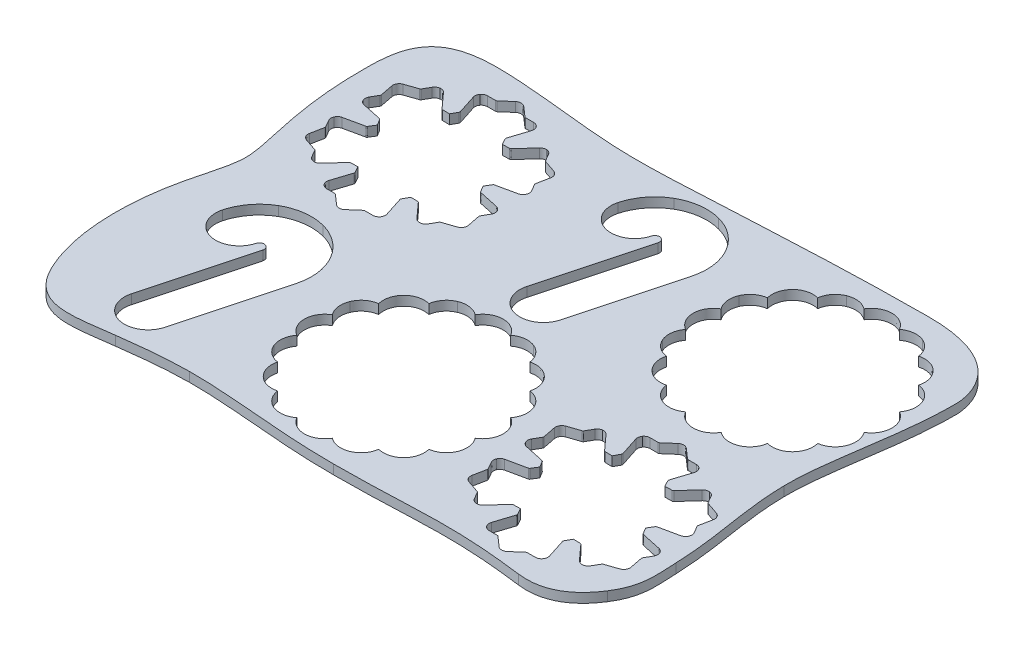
from build123d import *

# Parameters (mm, degrees)
BOSS_EXTRUDE1_DEPTH = 3


with BuildPart() as part:
    # Sketch1 → Boss-Extrude1 (new body)
    with BuildSketch(Plane(origin=(0, 0, 0), x_dir=(1, 0, 0), z_dir=(0, 1, 0))):
        with BuildLine():
            add(Edge.make_bspline(
                [(10.2066, -46.725), (-4.1601, -46.725), (-21.8076, -43.4442), (-36.1743, -43.4442)],
                knots=[0.933333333, 0.933333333, 0.933333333, 0.933333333, 1, 1, 1, 1], degree=3))
            add(Edge.make_bspline(
                [(-36.1743, -43.4442), (-53.4737, -43.4442), (-56.3096, -51.8729), (-56.4426, -63.5892)],
                knots=[0, 0, 0, 0, 0.066666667, 0.066666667, 0.066666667, 0.066666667], degree=3))
            add(Edge.make_bspline(
                [(-56.4426, -63.5892), (-56.7369, -89.5125), (-50.1871, -101.0414), (-50.9684, -109.4932)],
                knots=[0.066666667, 0.066666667, 0.066666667, 0.066666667, 0.133333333, 0.133333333, 0.133333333, 0.133333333], degree=3))
            add(Edge.make_bspline(
                [(-50.9684, -109.4932), (-51.4044, -114.2106), (-52.7481, -117.7745), (-54.2266, -124.1699)],
                knots=[0.133333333, 0.133333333, 0.133333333, 0.133333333, 0.2, 0.2, 0.2, 0.2], degree=3))
            add(Edge.make_bspline(
                [(-54.2266, -124.1699), (-57.4788, -138.2379), (-57.7685, -155.3929), (-51.6012, -168.625)],
                knots=[0.2, 0.2, 0.2, 0.2, 0.266666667, 0.266666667, 0.266666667, 0.266666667], degree=3))
            add(Edge.make_bspline(
                [(-51.6012, -168.625), (-45.3179, -182.1062), (-34.9935, -178.9865), (-22.7994, -177.4606)],
                knots=[0.266666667, 0.266666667, 0.266666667, 0.266666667, 0.333333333, 0.333333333, 0.333333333, 0.333333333], degree=3))
            add(Edge.make_bspline(
                [(-22.7994, -177.4606), (-16.2998, -176.6473), (-9.5271, -175.7405), (-1.0433, -175.6612)],
                knots=[0.333333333, 0.333333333, 0.333333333, 0.333333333, 0.4, 0.4, 0.4, 0.4], degree=3))
            add(Edge.make_bspline(
                [(-1.0433, -175.6612), (12.98, -175.5302), (28.1615, -178.2596), (47.1667, -178.2283)],
                knots=[0.4, 0.4, 0.4, 0.4, 0.466666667, 0.466666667, 0.466666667, 0.466666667], degree=3))
            add(Edge.make_bspline(
                [(47.1667, -178.2283), (73.1303, -178.1855), (80.9016, -175.7924), (106.5724, -179.1324)],
                knots=[0.466666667, 0.466666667, 0.466666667, 0.466666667, 0.533333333, 0.533333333, 0.533333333, 0.533333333], degree=3))
            add(Edge.make_bspline(
                [(106.5724, -179.1324), (116.5716, -180.4333), (122.2318, -174.4851), (125.3709, -169.6066)],
                knots=[0.533333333, 0.533333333, 0.533333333, 0.533333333, 0.6, 0.6, 0.6, 0.6], degree=3))
            add(Edge.make_bspline(
                [(125.3709, -169.6066), (129.4875, -163.2087), (128.8669, -158.303), (128.5409, -151.0747)],
                knots=[0.6, 0.6, 0.6, 0.6, 0.666666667, 0.666666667, 0.666666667, 0.666666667], degree=3))
            add(Edge.make_bspline(
                [(128.5409, -151.0747), (127.8277, -135.2704), (124.7905, -127.0117), (124.4948, -112.8693)],
                knots=[0.666666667, 0.666666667, 0.666666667, 0.666666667, 0.733333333, 0.733333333, 0.733333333, 0.733333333], degree=3))
            add(Edge.make_bspline(
                [(124.4948, -112.8693), (124.2114, -99.3196), (129.2574, -80.9721), (129.2574, -63.3776), (129.2574, -61.7415), (129.2574, -43.4443), (100.8566, -43.5364)],
                knots=[0.733333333, 0.733333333, 0.733333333, 0.733333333, 0.8, 0.8, 0.8, 0.866666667, 0.866666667, 0.866666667, 0.866666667], degree=3))
            add(Edge.make_bspline(
                [(100.8566, -43.5364), (61.0797, -43.6655), (27.679, -46.9673), (10.2066, -46.725)],
                knots=[0.866666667, 0.866666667, 0.866666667, 0.866666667, 0.933333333, 0.933333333, 0.933333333, 0.933333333], degree=3))
        make_face()
        with BuildLine():
            Line((-5.452636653, -78.2747), (-4.294807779, -80.176614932))
            add(Edge.make_bspline(
                [(-4.294807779, -80.176614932), (-4.277141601, -80.20563794), (-4.235536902, -80.260448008), (-4.159250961, -80.327006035), (-4.071320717, -80.377165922), (-4.005938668, -80.39842295), (-3.972744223, -80.405561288)],
                knots=[0.00980376, 0.00980376, 0.00980376, 0.00980376, 0.012254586, 0.014705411, 0.017156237, 0.019607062, 0.019607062, 0.019607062, 0.019607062], degree=3))
            Line((-3.972744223, -80.405561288), (2.219598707, -81.735749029))
            add(Edge.make_bspline(
                [(2.219598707, -81.735749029), (2.373701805, -81.768845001), (2.676844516, -81.873025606), (3.072063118, -82.125105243), (3.399659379, -82.460376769), (3.563647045, -82.735700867), (3.627594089, -82.87972959)],
                knots=[0.029411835, 0.029411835, 0.029411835, 0.029411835, 0.031862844, 0.034313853, 0.036764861, 0.03921587, 0.03921587, 0.03921587, 0.03921587], degree=3))
            add(Edge.make_bspline(
                [(3.627594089, -82.87972959), (3.691502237, -83.023712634), (3.785279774, -83.330035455), (3.813803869, -83.797789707), (3.736039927, -84.25992804), (3.610388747, -84.554688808), (3.531597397, -84.691126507)],
                knots=[0.039215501, 0.039215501, 0.039215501, 0.039215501, 0.041666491, 0.044117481, 0.04656847, 0.04901946, 0.04901946, 0.04901946, 0.04901946], degree=3))
            Line((3.531597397, -84.691126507), (2.25063227, -86.909766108))
            add(Edge.make_bspline(
                [(2.25063227, -86.909766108), (2.235690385, -86.935658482), (2.210492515, -86.990272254), (2.187910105, -87.077668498), (2.181133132, -87.167660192), (2.187393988, -87.227456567), (2.193195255, -87.256772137)],
                knots=[0.058824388, 0.058824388, 0.058824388, 0.058824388, 0.061275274, 0.063726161, 0.066177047, 0.068627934, 0.068627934, 0.068627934, 0.068627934], degree=3))
            Line((2.193195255, -87.256772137), (2.99360199, -91.304506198))
            add(Edge.make_bspline(
                [(2.99360199, -91.304506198), (3.040523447, -91.541790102), (3.045196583, -92.04452209), (2.797496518, -92.711994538), (2.34336144, -93.26031387), (1.905618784, -93.5076741), (1.676650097, -93.585684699)],
                knots=[0.078431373, 0.078431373, 0.078431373, 0.078431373, 0.080882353, 0.083333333, 0.085784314, 0.088235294, 0.088235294, 0.088235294, 0.088235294], degree=3))
            Line((1.676650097, -93.585684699), (-2.229030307, -94.916378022))
            add(Edge.make_bspline(
                [(-2.229030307, -94.916378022), (-2.257444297, -94.926060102), (-2.312805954, -94.950716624), (-2.386871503, -95.001302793), (-2.450869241, -95.064131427), (-2.485794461, -95.113640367), (-2.50080398, -95.139628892)],
                knots=[0.098039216, 0.098039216, 0.098039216, 0.098039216, 0.100490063, 0.102940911, 0.105391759, 0.107842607, 0.107842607, 0.107842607, 0.107842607], degree=3))
            Line((-2.50080398, -95.139628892), (-3.781782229, -97.35829122))
            add(Edge.make_bspline(
                [(-3.781782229, -97.35829122), (-3.860586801, -97.494799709), (-4.052785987, -97.751336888), (-4.414032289, -98.050134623), (-4.833732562, -98.259007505), (-5.146195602, -98.330520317), (-5.30293743, -98.347118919)],
                knots=[0.117647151, 0.117647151, 0.117647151, 0.117647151, 0.120098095, 0.122549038, 0.124999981, 0.127450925, 0.127450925, 0.127450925, 0.127450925], degree=3))
            add(Edge.make_bspline(
                [(-5.30293743, -98.347118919), (-5.459611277, -98.363715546), (-5.779971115, -98.359271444), (-6.233981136, -98.243134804), (-6.64976936, -98.026917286), (-6.891488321, -97.81653066), (-6.997166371, -97.699647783)],
                knots=[0.127451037, 0.127451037, 0.127451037, 0.127451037, 0.12990196, 0.132352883, 0.134803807, 0.13725473, 0.13725473, 0.13725473, 0.13725473], degree=3))
            Line((-6.997166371, -97.699647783), (-11.245356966, -93.002058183))
            add(Edge.make_bspline(
                [(-11.245356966, -93.002058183), (-11.268114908, -92.976889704), (-11.319155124, -92.930930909), (-11.406593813, -92.879816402), (-11.502450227, -92.846994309), (-11.570672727, -92.838358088), (-11.604630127, -92.837564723)],
                knots=[0.147058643, 0.147058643, 0.147058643, 0.147058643, 0.149509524, 0.151960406, 0.154411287, 0.156862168, 0.156862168, 0.156862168, 0.156862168], degree=3))
            Line((-11.604630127, -92.837564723), (-13.830710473, -92.785924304))
            Line((-13.830710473, -92.785924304), (-14.898866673, -94.73951883))
            add(Edge.make_bspline(
                [(-14.898866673, -94.73951883), (-14.915148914, -94.769317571), (-14.941744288, -94.83266254), (-14.961299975, -94.932255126), (-14.960757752, -95.033666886), (-14.946532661, -95.10068674), (-14.936135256, -95.132930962)],
                knots=[0.176471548, 0.176471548, 0.176471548, 0.176471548, 0.178922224, 0.181372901, 0.183823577, 0.186274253, 0.186274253, 0.186274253, 0.186274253], degree=3))
            Line((-14.936135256, -95.132930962), (-12.991942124, -101.160709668))
            add(Edge.make_bspline(
                [(-12.991942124, -101.160709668), (-12.943575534, -101.310651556), (-12.882429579, -101.625157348), (-12.903217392, -102.09334686), (-13.029486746, -102.544687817), (-13.185721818, -102.824486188), (-13.278469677, -102.95187512)],
                knots=[0.196078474, 0.196078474, 0.196078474, 0.196078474, 0.1985294, 0.200980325, 0.20343125, 0.205882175, 0.205882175, 0.205882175, 0.205882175], degree=3))
            add(Edge.make_bspline(
                [(-13.278469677, -102.95187512), (-13.371221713, -103.079297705), (-13.589390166, -103.31410097), (-13.980111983, -103.573088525), (-14.419464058, -103.736514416), (-14.737694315, -103.7747), (-14.8953, -103.7747)],
                knots=[0.205882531, 0.205882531, 0.205882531, 0.205882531, 0.208333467, 0.210784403, 0.213235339, 0.215686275, 0.215686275, 0.215686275, 0.215686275], degree=3))
            Line((-14.8953, -103.7747), (-17.4572, -103.7747))
            add(Edge.make_bspline(
                [(-17.4572, -103.7747), (-17.487227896, -103.7747), (-17.547618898, -103.780184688), (-17.633998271, -103.804175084), (-17.714803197, -103.842993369), (-17.763864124, -103.87862927), (-17.78646231, -103.898401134)],
                knots=[0.225490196, 0.225490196, 0.225490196, 0.225490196, 0.227941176, 0.230392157, 0.232843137, 0.235294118, 0.235294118, 0.235294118, 0.235294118], degree=3))
            Line((-17.78646231, -103.898401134), (-20.891650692, -106.615490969))
            add(Edge.make_bspline(
                [(-20.891650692, -106.615490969), (-21.073736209, -106.774807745), (-21.506727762, -107.030558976), (-22.2087, -107.150058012), (-22.910672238, -107.030558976), (-23.343663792, -106.774807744), (-23.525749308, -106.615490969)],
                knots=[0.245098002, 0.245098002, 0.245098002, 0.245098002, 0.247549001, 0.25, 0.252450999, 0.254901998, 0.254901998, 0.254901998, 0.254901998], degree=3))
            Line((-23.525749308, -106.615490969), (-26.63093769, -103.898401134))
            add(Edge.make_bspline(
                [(-26.63093769, -103.898401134), (-26.653535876, -103.87862927), (-26.702596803, -103.842993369), (-26.783401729, -103.804175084), (-26.869781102, -103.780184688), (-26.930172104, -103.7747), (-26.9602, -103.7747)],
                knots=[0.264705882, 0.264705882, 0.264705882, 0.264705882, 0.267156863, 0.269607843, 0.272058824, 0.274509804, 0.274509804, 0.274509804, 0.274509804], degree=3))
            Line((-26.9602, -103.7747), (-29.5221, -103.7747))
            add(Edge.make_bspline(
                [(-29.5221, -103.7747), (-29.679705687, -103.7747), (-29.997935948, -103.736514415), (-30.437288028, -103.57308852), (-30.828009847, -103.31410096), (-31.046178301, -103.079297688), (-31.138930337, -102.951875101)],
                knots=[0.284313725, 0.284313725, 0.284313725, 0.284313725, 0.286764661, 0.289215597, 0.291666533, 0.294117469, 0.294117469, 0.294117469, 0.294117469], degree=3))
            add(Edge.make_bspline(
                [(-31.138930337, -102.951875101), (-31.231678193, -102.824486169), (-31.38791326, -102.544687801), (-31.51418261, -102.093346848), (-31.53497042, -101.625157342), (-31.473824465, -101.310651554), (-31.425457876, -101.160709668)],
                knots=[0.294117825, 0.294117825, 0.294117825, 0.294117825, 0.29656875, 0.299019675, 0.3014706, 0.303921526, 0.303921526, 0.303921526, 0.303921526], degree=3))
            Line((-31.425457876, -101.160709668), (-29.481264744, -95.132930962))
            add(Edge.make_bspline(
                [(-29.481264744, -95.132930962), (-29.470867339, -95.10068674), (-29.456642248, -95.033666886), (-29.456100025, -94.932255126), (-29.475655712, -94.83266254), (-29.502251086, -94.769317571), (-29.518533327, -94.73951883)],
                knots=[0.313725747, 0.313725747, 0.313725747, 0.313725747, 0.316176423, 0.318627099, 0.321077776, 0.323528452, 0.323528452, 0.323528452, 0.323528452], degree=3))
            Line((-29.518533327, -94.73951883), (-30.586689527, -92.785924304))
            Line((-30.586689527, -92.785924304), (-32.812769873, -92.837564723))
            add(Edge.make_bspline(
                [(-32.812769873, -92.837564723), (-32.846727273, -92.838358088), (-32.914949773, -92.846994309), (-33.010806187, -92.879816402), (-33.098244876, -92.930930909), (-33.149285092, -92.976889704), (-33.172043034, -93.002058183)],
                knots=[0.343137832, 0.343137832, 0.343137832, 0.343137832, 0.345588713, 0.348039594, 0.350490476, 0.352941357, 0.352941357, 0.352941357, 0.352941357], degree=3))
            Line((-33.172043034, -93.002058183), (-37.420233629, -97.699647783))
            add(Edge.make_bspline(
                [(-37.420233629, -97.699647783), (-37.525911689, -97.816530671), (-37.767630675, -98.026917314), (-38.183418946, -98.243134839), (-38.637429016, -98.359271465), (-38.957788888, -98.363715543), (-39.114462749, -98.3471189)],
                knots=[0.36274527, 0.36274527, 0.36274527, 0.36274527, 0.365196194, 0.367647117, 0.37009804, 0.372548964, 0.372548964, 0.372548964, 0.372548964], degree=3))
            add(Edge.make_bspline(
                [(-39.114462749, -98.3471189), (-39.27120456, -98.330520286), (-39.583667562, -98.259007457), (-40.003367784, -98.050134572), (-40.364614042, -97.751336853), (-40.556813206, -97.494799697), (-40.635617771, -97.35829122)],
                knots=[0.372549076, 0.372549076, 0.372549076, 0.372549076, 0.375000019, 0.377450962, 0.379901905, 0.382352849, 0.382352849, 0.382352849, 0.382352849], degree=3))
            Line((-40.635617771, -97.35829122), (-41.91659602, -95.139628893))
            add(Edge.make_bspline(
                [(-41.91659602, -95.139628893), (-41.931605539, -95.113640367), (-41.966530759, -95.064131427), (-42.030528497, -95.001302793), (-42.104594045, -94.950716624), (-42.159955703, -94.926060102), (-42.188369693, -94.916378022)],
                knots=[0.392157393, 0.392157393, 0.392157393, 0.392157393, 0.394608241, 0.397059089, 0.399509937, 0.401960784, 0.401960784, 0.401960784, 0.401960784], degree=3))
            Line((-42.188369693, -94.916378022), (-46.094050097, -93.585684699))
            add(Edge.make_bspline(
                [(-46.094050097, -93.585684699), (-46.323018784, -93.5076741), (-46.76076144, -93.26031387), (-47.214896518, -92.711994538), (-47.462596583, -92.04452209), (-47.457923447, -91.541790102), (-47.41100199, -91.304506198)],
                knots=[0.411764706, 0.411764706, 0.411764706, 0.411764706, 0.414215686, 0.416666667, 0.419117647, 0.421568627, 0.421568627, 0.421568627, 0.421568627], degree=3))
            Line((-47.41100199, -91.304506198), (-46.610595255, -87.256772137))
            add(Edge.make_bspline(
                [(-46.610595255, -87.256772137), (-46.604793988, -87.227456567), (-46.598533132, -87.167660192), (-46.605310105, -87.077668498), (-46.627892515, -86.990272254), (-46.653090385, -86.935658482), (-46.66803227, -86.909766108)],
                knots=[0.431372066, 0.431372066, 0.431372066, 0.431372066, 0.433822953, 0.436273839, 0.438724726, 0.441175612, 0.441175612, 0.441175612, 0.441175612], degree=3))
            Line((-46.66803227, -86.909766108), (-47.949006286, -84.691111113))
            add(Edge.make_bspline(
                [(-47.949006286, -84.691111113), (-48.0277724, -84.55469624), (-48.153382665, -84.260000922), (-48.231167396, -83.79793051), (-48.202717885, -83.330208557), (-48.108999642, -83.023881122), (-48.045122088, -82.879892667)],
                knots=[0.450980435, 0.450980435, 0.450980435, 0.450980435, 0.453431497, 0.455882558, 0.45833362, 0.460784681, 0.460784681, 0.460784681, 0.460784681], degree=3))
            add(Edge.make_bspline(
                [(-48.045122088, -82.879892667), (-47.981179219, -82.73584049), (-47.817202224, -82.460464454), (-47.489575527, -82.125128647), (-47.09430239, -81.87302117), (-46.791113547, -81.768841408), (-46.63698877, -81.735746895)],
                knots=[0.460783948, 0.460783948, 0.460783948, 0.460783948, 0.463234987, 0.465686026, 0.468137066, 0.470588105, 0.470588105, 0.470588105, 0.470588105], degree=3))
            Line((-46.63698877, -81.735746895), (-40.444655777, -80.405561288))
            add(Edge.make_bspline(
                [(-40.444655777, -80.405561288), (-40.411461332, -80.39842295), (-40.346079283, -80.377165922), (-40.258149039, -80.327006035), (-40.181863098, -80.260448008), (-40.140258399, -80.20563794), (-40.12259222, -80.176614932)],
                knots=[0.480392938, 0.480392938, 0.480392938, 0.480392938, 0.482843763, 0.485294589, 0.487745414, 0.49019624, 0.49019624, 0.49019624, 0.49019624], degree=3))
            Line((-40.12259222, -80.176614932), (-38.964763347, -78.2747))
            Line((-38.964763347, -78.2747), (-40.12259222, -76.372785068))
            add(Edge.make_bspline(
                [(-40.12259222, -76.372785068), (-40.140258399, -76.34376206), (-40.181863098, -76.288951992), (-40.258149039, -76.222393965), (-40.346079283, -76.172234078), (-40.411461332, -76.15097705), (-40.444655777, -76.143838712)],
                knots=[0.50980376, 0.50980376, 0.50980376, 0.50980376, 0.512254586, 0.514705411, 0.517156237, 0.519607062, 0.519607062, 0.519607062, 0.519607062], degree=3))
            Line((-40.444655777, -76.143838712), (-46.63698877, -74.813653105))
            add(Edge.make_bspline(
                [(-46.63698877, -74.813653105), (-46.791113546, -74.780558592), (-47.09430239, -74.67637883), (-47.489575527, -74.424271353), (-47.817202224, -74.088935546), (-47.981179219, -73.81355951), (-48.045122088, -73.669507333)],
                knots=[0.529411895, 0.529411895, 0.529411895, 0.529411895, 0.531862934, 0.534313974, 0.536765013, 0.539216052, 0.539216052, 0.539216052, 0.539216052], degree=3))
            add(Edge.make_bspline(
                [(-48.045122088, -73.669507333), (-48.108999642, -73.525518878), (-48.202717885, -73.219191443), (-48.231167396, -72.75146949), (-48.153382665, -72.289399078), (-48.0277724, -71.99470376), (-47.949006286, -71.858288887)],
                knots=[0.539215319, 0.539215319, 0.539215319, 0.539215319, 0.54166638, 0.544117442, 0.546568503, 0.549019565, 0.549019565, 0.549019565, 0.549019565], degree=3))
            Line((-47.949006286, -71.858288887), (-46.66803227, -69.639633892))
            add(Edge.make_bspline(
                [(-46.66803227, -69.639633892), (-46.653090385, -69.613741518), (-46.627892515, -69.559127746), (-46.605310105, -69.471731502), (-46.598533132, -69.381739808), (-46.604793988, -69.321943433), (-46.610595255, -69.292627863)],
                knots=[0.558824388, 0.558824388, 0.558824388, 0.558824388, 0.561275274, 0.563726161, 0.566177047, 0.568627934, 0.568627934, 0.568627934, 0.568627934], degree=3))
            Line((-46.610595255, -69.292627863), (-47.41100199, -65.244893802))
            add(Edge.make_bspline(
                [(-47.41100199, -65.244893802), (-47.457923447, -65.007609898), (-47.462596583, -64.50487791), (-47.214896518, -63.837405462), (-46.76076144, -63.28908613), (-46.323018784, -63.0417259), (-46.094050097, -62.963715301)],
                knots=[0.578431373, 0.578431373, 0.578431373, 0.578431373, 0.580882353, 0.583333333, 0.585784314, 0.588235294, 0.588235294, 0.588235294, 0.588235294], degree=3))
            Line((-46.094050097, -62.963715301), (-42.188369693, -61.633021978))
            add(Edge.make_bspline(
                [(-42.188369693, -61.633021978), (-42.159955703, -61.623339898), (-42.104594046, -61.598683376), (-42.030528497, -61.548097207), (-41.966530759, -61.485268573), (-41.931605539, -61.435759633), (-41.91659602, -61.409771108)],
                knots=[0.598039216, 0.598039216, 0.598039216, 0.598039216, 0.600490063, 0.602940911, 0.605391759, 0.607842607, 0.607842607, 0.607842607, 0.607842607], degree=3))
            Line((-41.91659602, -61.409771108), (-40.635617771, -59.19110878))
            add(Edge.make_bspline(
                [(-40.635617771, -59.19110878), (-40.556813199, -59.054600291), (-40.364614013, -58.798063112), (-40.003367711, -58.499265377), (-39.583667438, -58.290392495), (-39.271204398, -58.218879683), (-39.114462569, -58.202281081)],
                knots=[0.617647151, 0.617647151, 0.617647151, 0.617647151, 0.620098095, 0.622549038, 0.624999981, 0.627450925, 0.627450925, 0.627450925, 0.627450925], degree=3))
            add(Edge.make_bspline(
                [(-39.114462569, -58.202281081), (-38.957788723, -58.185684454), (-38.637428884, -58.190128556), (-38.183418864, -58.306265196), (-37.76763064, -58.522482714), (-37.525911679, -58.73286934), (-37.420233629, -58.849752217)],
                knots=[0.627451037, 0.627451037, 0.627451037, 0.627451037, 0.62990196, 0.632352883, 0.634803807, 0.63725473, 0.63725473, 0.63725473, 0.63725473], degree=3))
            Line((-37.420233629, -58.849752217), (-33.172043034, -63.547341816))
            add(Edge.make_bspline(
                [(-33.172043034, -63.547341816), (-33.149285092, -63.572510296), (-33.098244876, -63.618469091), (-33.010806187, -63.669583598), (-32.914949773, -63.702405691), (-32.846727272, -63.711041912), (-32.812769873, -63.711835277)],
                knots=[0.647058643, 0.647058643, 0.647058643, 0.647058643, 0.649509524, 0.651960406, 0.654411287, 0.656862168, 0.656862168, 0.656862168, 0.656862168], degree=3))
            Line((-32.812769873, -63.711835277), (-30.586689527, -63.763475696))
            Line((-30.586689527, -63.763475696), (-29.518533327, -61.80988117))
            add(Edge.make_bspline(
                [(-29.518533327, -61.80988117), (-29.502251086, -61.780082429), (-29.475655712, -61.71673746), (-29.456100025, -61.617144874), (-29.456642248, -61.515733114), (-29.470867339, -61.44871326), (-29.481264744, -61.416469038)],
                knots=[0.676471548, 0.676471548, 0.676471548, 0.676471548, 0.678922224, 0.681372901, 0.683823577, 0.686274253, 0.686274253, 0.686274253, 0.686274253], degree=3))
            Line((-29.481264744, -61.416469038), (-31.425457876, -55.388690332))
            add(Edge.make_bspline(
                [(-31.425457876, -55.388690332), (-31.473824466, -55.238748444), (-31.534970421, -54.924242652), (-31.514182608, -54.45605314), (-31.387913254, -54.004712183), (-31.231678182, -53.724913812), (-31.138930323, -53.597524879)],
                knots=[0.696078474, 0.696078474, 0.696078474, 0.696078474, 0.6985294, 0.700980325, 0.70343125, 0.705882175, 0.705882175, 0.705882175, 0.705882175], degree=3))
            add(Edge.make_bspline(
                [(-31.138930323, -53.597524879), (-31.046178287, -53.470102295), (-30.828009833, -53.23529903), (-30.437288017, -52.976311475), (-29.997935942, -52.812885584), (-29.679705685, -52.7747), (-29.5221, -52.7747)],
                knots=[0.705882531, 0.705882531, 0.705882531, 0.705882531, 0.708333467, 0.710784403, 0.713235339, 0.715686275, 0.715686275, 0.715686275, 0.715686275], degree=3))
            Line((-29.5221, -52.7747), (-26.9602, -52.7747))
            add(Edge.make_bspline(
                [(-26.9602, -52.7747), (-26.930172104, -52.7747), (-26.869781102, -52.769215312), (-26.783401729, -52.745224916), (-26.702596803, -52.706406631), (-26.653535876, -52.67077073), (-26.63093769, -52.650998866)],
                knots=[0.725490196, 0.725490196, 0.725490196, 0.725490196, 0.727941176, 0.730392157, 0.732843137, 0.735294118, 0.735294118, 0.735294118, 0.735294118], degree=3))
            Line((-26.63093769, -52.650998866), (-23.525749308, -49.933909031))
            add(Edge.make_bspline(
                [(-23.525749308, -49.933909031), (-23.343663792, -49.774592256), (-22.910672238, -49.518841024), (-22.2087, -49.399341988), (-21.506727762, -49.518841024), (-21.073736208, -49.774592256), (-20.891650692, -49.933909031)],
                knots=[0.745098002, 0.745098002, 0.745098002, 0.745098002, 0.747549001, 0.75, 0.752450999, 0.754901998, 0.754901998, 0.754901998, 0.754901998], degree=3))
            Line((-20.891650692, -49.933909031), (-17.78646231, -52.650998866))
            add(Edge.make_bspline(
                [(-17.78646231, -52.650998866), (-17.763864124, -52.67077073), (-17.714803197, -52.706406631), (-17.633998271, -52.745224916), (-17.547618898, -52.769215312), (-17.487227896, -52.7747), (-17.4572, -52.7747)],
                knots=[0.764705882, 0.764705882, 0.764705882, 0.764705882, 0.767156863, 0.769607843, 0.772058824, 0.774509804, 0.774509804, 0.774509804, 0.774509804], degree=3))
            Line((-17.4572, -52.7747), (-14.8953, -52.7747))
            add(Edge.make_bspline(
                [(-14.8953, -52.7747), (-14.737694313, -52.7747), (-14.419464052, -52.812885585), (-13.980111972, -52.97631148), (-13.589390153, -53.23529904), (-13.371221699, -53.470102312), (-13.278469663, -53.597524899)],
                knots=[0.784313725, 0.784313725, 0.784313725, 0.784313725, 0.786764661, 0.789215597, 0.791666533, 0.794117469, 0.794117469, 0.794117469, 0.794117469], degree=3))
            add(Edge.make_bspline(
                [(-13.278469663, -53.597524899), (-13.185721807, -53.724913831), (-13.02948674, -54.004712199), (-12.90321739, -54.456053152), (-12.88242958, -54.924242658), (-12.943575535, -55.238748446), (-12.991942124, -55.388690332)],
                knots=[0.794117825, 0.794117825, 0.794117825, 0.794117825, 0.79656875, 0.799019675, 0.8014706, 0.803921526, 0.803921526, 0.803921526, 0.803921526], degree=3))
            Line((-12.991942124, -55.388690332), (-14.936135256, -61.416469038))
            add(Edge.make_bspline(
                [(-14.936135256, -61.416469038), (-14.946532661, -61.44871326), (-14.960757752, -61.515733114), (-14.961299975, -61.617144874), (-14.941744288, -61.71673746), (-14.915148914, -61.780082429), (-14.898866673, -61.80988117)],
                knots=[0.813725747, 0.813725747, 0.813725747, 0.813725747, 0.816176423, 0.818627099, 0.821077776, 0.823528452, 0.823528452, 0.823528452, 0.823528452], degree=3))
            Line((-14.898866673, -61.80988117), (-13.830710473, -63.763475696))
            Line((-13.830710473, -63.763475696), (-11.604630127, -63.711835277))
            add(Edge.make_bspline(
                [(-11.604630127, -63.711835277), (-11.570672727, -63.711041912), (-11.502450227, -63.702405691), (-11.406593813, -63.669583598), (-11.319155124, -63.618469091), (-11.268114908, -63.572510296), (-11.245356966, -63.547341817)],
                knots=[0.843137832, 0.843137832, 0.843137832, 0.843137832, 0.845588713, 0.848039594, 0.850490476, 0.852941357, 0.852941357, 0.852941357, 0.852941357], degree=3))
            Line((-11.245356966, -63.547341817), (-6.997166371, -58.849752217))
            add(Edge.make_bspline(
                [(-6.997166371, -58.849752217), (-6.891488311, -58.732869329), (-6.649769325, -58.522482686), (-6.233981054, -58.306265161), (-5.779970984, -58.190128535), (-5.459611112, -58.185684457), (-5.302937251, -58.2022811)],
                knots=[0.86274527, 0.86274527, 0.86274527, 0.86274527, 0.865196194, 0.867647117, 0.87009804, 0.872548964, 0.872548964, 0.872548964, 0.872548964], degree=3))
            add(Edge.make_bspline(
                [(-5.302937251, -58.2022811), (-5.14619544, -58.218879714), (-4.833732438, -58.290392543), (-4.414032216, -58.499265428), (-4.052785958, -58.798063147), (-3.860586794, -59.054600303), (-3.781782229, -59.19110878)],
                knots=[0.872549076, 0.872549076, 0.872549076, 0.872549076, 0.875000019, 0.877450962, 0.879901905, 0.882352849, 0.882352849, 0.882352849, 0.882352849], degree=3))
            Line((-3.781782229, -59.19110878), (-2.50080398, -61.409771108))
            add(Edge.make_bspline(
                [(-2.50080398, -61.409771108), (-2.485794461, -61.435759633), (-2.450869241, -61.485268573), (-2.386871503, -61.548097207), (-2.312805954, -61.598683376), (-2.257444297, -61.623339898), (-2.229030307, -61.633021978)],
                knots=[0.892157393, 0.892157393, 0.892157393, 0.892157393, 0.894608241, 0.897059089, 0.899509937, 0.901960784, 0.901960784, 0.901960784, 0.901960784], degree=3))
            Line((-2.229030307, -61.633021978), (1.676650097, -62.963715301))
            add(Edge.make_bspline(
                [(1.676650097, -62.963715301), (1.905618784, -63.0417259), (2.34336144, -63.28908613), (2.797496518, -63.837405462), (3.045196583, -64.50487791), (3.040523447, -65.007609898), (2.99360199, -65.244893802)],
                knots=[0.911764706, 0.911764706, 0.911764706, 0.911764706, 0.914215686, 0.916666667, 0.919117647, 0.921568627, 0.921568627, 0.921568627, 0.921568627], degree=3))
            Line((2.99360199, -65.244893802), (2.193195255, -69.292627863))
            add(Edge.make_bspline(
                [(2.193195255, -69.292627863), (2.187393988, -69.321943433), (2.181133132, -69.381739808), (2.187910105, -69.471731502), (2.210492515, -69.559127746), (2.235690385, -69.613741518), (2.25063227, -69.639633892)],
                knots=[0.931372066, 0.931372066, 0.931372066, 0.931372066, 0.933822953, 0.936273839, 0.938724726, 0.941175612, 0.941175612, 0.941175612, 0.941175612], degree=3))
            Line((2.25063227, -69.639633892), (3.531606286, -71.858288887))
            add(Edge.make_bspline(
                [(3.531606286, -71.858288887), (3.6103724, -71.99470376), (3.735982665, -72.289399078), (3.813767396, -72.75146949), (3.785317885, -73.219191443), (3.691599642, -73.525518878), (3.627722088, -73.669507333)],
                knots=[0.950980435, 0.950980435, 0.950980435, 0.950980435, 0.953431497, 0.955882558, 0.95833362, 0.960784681, 0.960784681, 0.960784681, 0.960784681], degree=3))
            add(Edge.make_bspline(
                [(3.627722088, -73.669507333), (3.563779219, -73.81355951), (3.399802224, -74.088935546), (3.072175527, -74.424271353), (2.67690239, -74.67637883), (2.373713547, -74.780558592), (2.21958877, -74.813653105)],
                knots=[0.960783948, 0.960783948, 0.960783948, 0.960783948, 0.963234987, 0.965686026, 0.968137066, 0.970588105, 0.970588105, 0.970588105, 0.970588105], degree=3))
            Line((2.21958877, -74.813653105), (-3.972744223, -76.143838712))
            add(Edge.make_bspline(
                [(-3.972744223, -76.143838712), (-4.005938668, -76.15097705), (-4.071320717, -76.172234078), (-4.159250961, -76.222393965), (-4.235536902, -76.288951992), (-4.277141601, -76.34376206), (-4.29480778, -76.372785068)],
                knots=[0.980392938, 0.980392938, 0.980392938, 0.980392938, 0.982843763, 0.985294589, 0.987745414, 0.99019624, 0.99019624, 0.99019624, 0.99019624], degree=3))
            Line((-4.29480778, -76.372785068), (-5.452636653, -78.2747))
        make_face(mode=Mode.SUBTRACT)
        with BuildLine():
            Line((114.149363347, -146.3616), (115.30719222, -148.263514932))
            add(Edge.make_bspline(
                [(115.30719222, -148.263514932), (115.324858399, -148.29253794), (115.366463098, -148.347348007), (115.442749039, -148.413906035), (115.530679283, -148.464065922), (115.596061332, -148.48532295), (115.629255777, -148.492461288)],
                knots=[0.00980376, 0.00980376, 0.00980376, 0.00980376, 0.012254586, 0.014705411, 0.017156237, 0.019607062, 0.019607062, 0.019607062, 0.019607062], degree=3))
            Line((115.629255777, -148.492461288), (121.821598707, -149.822649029))
            add(Edge.make_bspline(
                [(121.821598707, -149.822649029), (121.975701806, -149.855745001), (122.278844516, -149.959925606), (122.674063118, -150.212005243), (123.001659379, -150.547276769), (123.165647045, -150.822600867), (123.229594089, -150.96662959)],
                knots=[0.029411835, 0.029411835, 0.029411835, 0.029411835, 0.031862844, 0.034313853, 0.036764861, 0.03921587, 0.03921587, 0.03921587, 0.03921587], degree=3))
            add(Edge.make_bspline(
                [(123.229594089, -150.96662959), (123.293502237, -151.110612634), (123.387279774, -151.416935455), (123.415803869, -151.884689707), (123.338039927, -152.34682804), (123.212388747, -152.641588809), (123.133597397, -152.778026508)],
                knots=[0.039215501, 0.039215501, 0.039215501, 0.039215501, 0.041666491, 0.044117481, 0.04656847, 0.04901946, 0.04901946, 0.04901946, 0.04901946], degree=3))
            Line((123.133597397, -152.778026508), (121.85263227, -154.996666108))
            add(Edge.make_bspline(
                [(121.85263227, -154.996666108), (121.837690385, -155.022558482), (121.812492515, -155.077172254), (121.789910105, -155.164568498), (121.783133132, -155.254560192), (121.789393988, -155.314356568), (121.795195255, -155.343672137)],
                knots=[0.058824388, 0.058824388, 0.058824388, 0.058824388, 0.061275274, 0.063726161, 0.066177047, 0.068627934, 0.068627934, 0.068627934, 0.068627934], degree=3))
            Line((121.795195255, -155.343672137), (122.59560199, -159.391406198))
            add(Edge.make_bspline(
                [(122.59560199, -159.391406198), (122.642523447, -159.628690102), (122.647196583, -160.13142209), (122.399496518, -160.798894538), (121.94536144, -161.34721387), (121.507618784, -161.5945741), (121.278650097, -161.672584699)],
                knots=[0.078431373, 0.078431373, 0.078431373, 0.078431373, 0.080882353, 0.083333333, 0.085784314, 0.088235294, 0.088235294, 0.088235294, 0.088235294], degree=3))
            Line((121.278650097, -161.672584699), (117.372969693, -163.003278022))
            add(Edge.make_bspline(
                [(117.372969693, -163.003278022), (117.344555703, -163.012960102), (117.289194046, -163.037616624), (117.215128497, -163.088202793), (117.151130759, -163.151031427), (117.116205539, -163.200540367), (117.10119602, -163.226528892)],
                knots=[0.098039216, 0.098039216, 0.098039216, 0.098039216, 0.100490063, 0.102940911, 0.105391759, 0.107842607, 0.107842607, 0.107842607, 0.107842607], degree=3))
            Line((117.10119602, -163.226528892), (115.820217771, -165.44519122))
            add(Edge.make_bspline(
                [(115.820217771, -165.44519122), (115.741413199, -165.581699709), (115.549214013, -165.838236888), (115.187967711, -166.137034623), (114.768267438, -166.345907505), (114.455804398, -166.417420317), (114.299062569, -166.434018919)],
                knots=[0.117647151, 0.117647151, 0.117647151, 0.117647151, 0.120098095, 0.122549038, 0.124999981, 0.127450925, 0.127450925, 0.127450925, 0.127450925], degree=3))
            add(Edge.make_bspline(
                [(114.299062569, -166.434018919), (114.142388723, -166.450615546), (113.822028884, -166.446171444), (113.368018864, -166.330034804), (112.95223064, -166.113817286), (112.710511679, -165.90343066), (112.604833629, -165.786547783)],
                knots=[0.127451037, 0.127451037, 0.127451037, 0.127451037, 0.12990196, 0.132352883, 0.134803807, 0.13725473, 0.13725473, 0.13725473, 0.13725473], degree=3))
            Line((112.604833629, -165.786547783), (108.356643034, -161.088958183))
            add(Edge.make_bspline(
                [(108.356643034, -161.088958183), (108.333885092, -161.063789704), (108.282844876, -161.017830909), (108.195406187, -160.966716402), (108.099549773, -160.933894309), (108.031327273, -160.925258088), (107.997369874, -160.924464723)],
                knots=[0.147058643, 0.147058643, 0.147058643, 0.147058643, 0.149509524, 0.151960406, 0.154411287, 0.156862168, 0.156862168, 0.156862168, 0.156862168], degree=3))
            Line((107.997369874, -160.924464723), (105.771289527, -160.872824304))
            Line((105.771289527, -160.872824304), (104.703133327, -162.82641883))
            add(Edge.make_bspline(
                [(104.703133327, -162.82641883), (104.686851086, -162.856217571), (104.660255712, -162.91956254), (104.640700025, -163.019155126), (104.641242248, -163.120566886), (104.655467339, -163.18758674), (104.665864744, -163.219830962)],
                knots=[0.176471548, 0.176471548, 0.176471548, 0.176471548, 0.178922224, 0.181372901, 0.183823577, 0.186274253, 0.186274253, 0.186274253, 0.186274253], degree=3))
            Line((104.665864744, -163.219830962), (106.610057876, -169.247609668))
            add(Edge.make_bspline(
                [(106.610057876, -169.247609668), (106.658424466, -169.397551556), (106.719570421, -169.712057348), (106.698782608, -170.18024686), (106.572513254, -170.631587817), (106.416278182, -170.911386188), (106.323530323, -171.038775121)],
                knots=[0.196078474, 0.196078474, 0.196078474, 0.196078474, 0.1985294, 0.200980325, 0.20343125, 0.205882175, 0.205882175, 0.205882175, 0.205882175], degree=3))
            add(Edge.make_bspline(
                [(106.323530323, -171.038775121), (106.230778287, -171.166197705), (106.012609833, -171.40100097), (105.621888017, -171.659988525), (105.182535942, -171.823414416), (104.864305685, -171.8616), (104.7067, -171.8616)],
                knots=[0.205882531, 0.205882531, 0.205882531, 0.205882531, 0.208333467, 0.210784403, 0.213235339, 0.215686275, 0.215686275, 0.215686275, 0.215686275], degree=3))
            Line((104.7067, -171.8616), (102.1448, -171.8616))
            add(Edge.make_bspline(
                [(102.1448, -171.8616), (102.114772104, -171.8616), (102.054381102, -171.867084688), (101.968001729, -171.891075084), (101.887196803, -171.929893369), (101.838135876, -171.96552927), (101.81553769, -171.985301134)],
                knots=[0.225490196, 0.225490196, 0.225490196, 0.225490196, 0.227941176, 0.230392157, 0.232843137, 0.235294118, 0.235294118, 0.235294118, 0.235294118], degree=3))
            Line((101.81553769, -171.985301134), (98.710349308, -174.702390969))
            add(Edge.make_bspline(
                [(98.710349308, -174.702390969), (98.528263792, -174.861707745), (98.095272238, -175.117458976), (97.3933, -175.236958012), (96.691327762, -175.117458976), (96.258336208, -174.861707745), (96.076250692, -174.702390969)],
                knots=[0.245098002, 0.245098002, 0.245098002, 0.245098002, 0.247549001, 0.25, 0.252450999, 0.254901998, 0.254901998, 0.254901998, 0.254901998], degree=3))
            Line((96.076250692, -174.702390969), (92.97106231, -171.985301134))
            add(Edge.make_bspline(
                [(92.97106231, -171.985301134), (92.948464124, -171.96552927), (92.899403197, -171.929893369), (92.818598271, -171.891075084), (92.732218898, -171.867084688), (92.671827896, -171.8616), (92.6418, -171.8616)],
                knots=[0.264705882, 0.264705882, 0.264705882, 0.264705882, 0.267156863, 0.269607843, 0.272058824, 0.274509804, 0.274509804, 0.274509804, 0.274509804], degree=3))
            Line((92.6418, -171.8616), (90.0799, -171.8616))
            add(Edge.make_bspline(
                [(90.0799, -171.8616), (89.922294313, -171.8616), (89.604064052, -171.823414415), (89.164711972, -171.65998852), (88.773990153, -171.40100096), (88.555821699, -171.166197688), (88.463069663, -171.038775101)],
                knots=[0.284313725, 0.284313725, 0.284313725, 0.284313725, 0.286764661, 0.289215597, 0.291666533, 0.294117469, 0.294117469, 0.294117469, 0.294117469], degree=3))
            add(Edge.make_bspline(
                [(88.463069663, -171.038775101), (88.370321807, -170.911386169), (88.21408674, -170.631587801), (88.08781739, -170.180246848), (88.06702958, -169.712057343), (88.128175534, -169.397551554), (88.176542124, -169.247609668)],
                knots=[0.294117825, 0.294117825, 0.294117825, 0.294117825, 0.29656875, 0.299019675, 0.3014706, 0.303921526, 0.303921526, 0.303921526, 0.303921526], degree=3))
            Line((88.176542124, -169.247609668), (90.120735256, -163.219830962))
            add(Edge.make_bspline(
                [(90.120735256, -163.219830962), (90.131132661, -163.187586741), (90.145357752, -163.120566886), (90.145899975, -163.019155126), (90.126344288, -162.91956254), (90.099748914, -162.856217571), (90.083466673, -162.82641883)],
                knots=[0.313725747, 0.313725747, 0.313725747, 0.313725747, 0.316176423, 0.318627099, 0.321077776, 0.323528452, 0.323528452, 0.323528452, 0.323528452], degree=3))
            Line((90.083466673, -162.82641883), (89.015310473, -160.872824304))
            Line((89.015310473, -160.872824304), (86.789230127, -160.924464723))
            add(Edge.make_bspline(
                [(86.789230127, -160.924464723), (86.755272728, -160.925258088), (86.687050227, -160.933894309), (86.591193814, -160.966716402), (86.503755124, -161.017830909), (86.452714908, -161.063789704), (86.429956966, -161.088958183)],
                knots=[0.343137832, 0.343137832, 0.343137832, 0.343137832, 0.345588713, 0.348039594, 0.350490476, 0.352941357, 0.352941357, 0.352941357, 0.352941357], degree=3))
            Line((86.429956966, -161.088958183), (82.181766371, -165.786547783))
            add(Edge.make_bspline(
                [(82.181766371, -165.786547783), (82.076088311, -165.903430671), (81.834369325, -166.113817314), (81.418581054, -166.330034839), (80.964570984, -166.446171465), (80.644211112, -166.450615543), (80.487537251, -166.4340189)],
                knots=[0.36274527, 0.36274527, 0.36274527, 0.36274527, 0.365196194, 0.367647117, 0.37009804, 0.372548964, 0.372548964, 0.372548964, 0.372548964], degree=3))
            add(Edge.make_bspline(
                [(80.487537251, -166.4340189), (80.33079544, -166.417420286), (80.018332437, -166.345907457), (79.598632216, -166.137034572), (79.237385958, -165.838236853), (79.045186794, -165.581699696), (78.966382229, -165.44519122)],
                knots=[0.372549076, 0.372549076, 0.372549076, 0.372549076, 0.375000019, 0.377450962, 0.379901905, 0.382352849, 0.382352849, 0.382352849, 0.382352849], degree=3))
            Line((78.966382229, -165.44519122), (77.68540398, -163.226528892))
            add(Edge.make_bspline(
                [(77.68540398, -163.226528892), (77.670394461, -163.200540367), (77.635469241, -163.151031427), (77.571471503, -163.088202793), (77.497405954, -163.037616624), (77.442044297, -163.012960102), (77.413630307, -163.003278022)],
                knots=[0.392157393, 0.392157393, 0.392157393, 0.392157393, 0.394608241, 0.397059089, 0.399509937, 0.401960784, 0.401960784, 0.401960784, 0.401960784], degree=3))
            Line((77.413630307, -163.003278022), (73.507949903, -161.672584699))
            add(Edge.make_bspline(
                [(73.507949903, -161.672584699), (73.278981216, -161.5945741), (72.84123856, -161.34721387), (72.387103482, -160.798894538), (72.139403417, -160.13142209), (72.144076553, -159.628690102), (72.19099801, -159.391406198)],
                knots=[0.411764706, 0.411764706, 0.411764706, 0.411764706, 0.414215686, 0.416666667, 0.419117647, 0.421568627, 0.421568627, 0.421568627, 0.421568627], degree=3))
            Line((72.19099801, -159.391406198), (72.991404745, -155.343672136))
            add(Edge.make_bspline(
                [(72.991404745, -155.343672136), (72.997206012, -155.314356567), (73.003466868, -155.254560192), (72.996689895, -155.164568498), (72.974107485, -155.077172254), (72.948909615, -155.022558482), (72.93396773, -154.996666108)],
                knots=[0.431372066, 0.431372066, 0.431372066, 0.431372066, 0.433822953, 0.436273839, 0.438724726, 0.441175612, 0.441175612, 0.441175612, 0.441175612], degree=3))
            Line((72.93396773, -154.996666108), (71.652993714, -152.778011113))
            add(Edge.make_bspline(
                [(71.652993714, -152.778011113), (71.5742276, -152.64159624), (71.448617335, -152.346900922), (71.370832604, -151.88483051), (71.399282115, -151.417108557), (71.493000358, -151.110781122), (71.556877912, -150.966792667)],
                knots=[0.450980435, 0.450980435, 0.450980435, 0.450980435, 0.453431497, 0.455882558, 0.45833362, 0.460784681, 0.460784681, 0.460784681, 0.460784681], degree=3))
            add(Edge.make_bspline(
                [(71.556877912, -150.966792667), (71.620820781, -150.82274049), (71.784797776, -150.547364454), (72.112424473, -150.212028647), (72.50769761, -149.95992117), (72.810886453, -149.855741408), (72.96501123, -149.822646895)],
                knots=[0.460783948, 0.460783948, 0.460783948, 0.460783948, 0.463234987, 0.465686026, 0.468137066, 0.470588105, 0.470588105, 0.470588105, 0.470588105], degree=3))
            Line((72.96501123, -149.822646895), (79.157344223, -148.492461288))
            add(Edge.make_bspline(
                [(79.157344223, -148.492461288), (79.190538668, -148.48532295), (79.255920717, -148.464065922), (79.343850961, -148.413906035), (79.420136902, -148.347348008), (79.461741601, -148.29253794), (79.47940778, -148.263514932)],
                knots=[0.480392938, 0.480392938, 0.480392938, 0.480392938, 0.482843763, 0.485294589, 0.487745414, 0.49019624, 0.49019624, 0.49019624, 0.49019624], degree=3))
            Line((79.47940778, -148.263514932), (80.637236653, -146.3616))
            Line((80.637236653, -146.3616), (79.47940778, -144.459685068))
            add(Edge.make_bspline(
                [(79.47940778, -144.459685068), (79.461741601, -144.43066206), (79.420136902, -144.375851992), (79.343850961, -144.309293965), (79.255920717, -144.259134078), (79.190538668, -144.23787705), (79.157344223, -144.230738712)],
                knots=[0.50980376, 0.50980376, 0.50980376, 0.50980376, 0.512254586, 0.514705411, 0.517156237, 0.519607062, 0.519607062, 0.519607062, 0.519607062], degree=3))
            Line((79.157344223, -144.230738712), (72.96501123, -142.900553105))
            add(Edge.make_bspline(
                [(72.96501123, -142.900553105), (72.810886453, -142.867458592), (72.50769761, -142.76327883), (72.112424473, -142.511171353), (71.784797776, -142.175835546), (71.620820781, -141.90045951), (71.556877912, -141.756407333)],
                knots=[0.529411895, 0.529411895, 0.529411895, 0.529411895, 0.531862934, 0.534313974, 0.536765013, 0.539216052, 0.539216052, 0.539216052, 0.539216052], degree=3))
            add(Edge.make_bspline(
                [(71.556877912, -141.756407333), (71.493000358, -141.612418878), (71.399282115, -141.306091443), (71.370832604, -140.83836949), (71.448617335, -140.376299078), (71.5742276, -140.08160376), (71.652993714, -139.945188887)],
                knots=[0.539215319, 0.539215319, 0.539215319, 0.539215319, 0.54166638, 0.544117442, 0.546568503, 0.549019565, 0.549019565, 0.549019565, 0.549019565], degree=3))
            Line((71.652993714, -139.945188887), (72.93396773, -137.726533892))
            add(Edge.make_bspline(
                [(72.93396773, -137.726533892), (72.948909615, -137.700641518), (72.974107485, -137.646027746), (72.996689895, -137.558631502), (73.003466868, -137.468639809), (72.997206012, -137.408843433), (72.991404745, -137.379527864)],
                knots=[0.558824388, 0.558824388, 0.558824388, 0.558824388, 0.561275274, 0.563726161, 0.566177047, 0.568627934, 0.568627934, 0.568627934, 0.568627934], degree=3))
            Line((72.991404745, -137.379527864), (72.19099801, -133.331793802))
            add(Edge.make_bspline(
                [(72.19099801, -133.331793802), (72.144076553, -133.094509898), (72.139403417, -132.59177791), (72.387103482, -131.924305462), (72.84123856, -131.37598613), (73.278981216, -131.1286259), (73.507949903, -131.050615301)],
                knots=[0.578431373, 0.578431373, 0.578431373, 0.578431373, 0.580882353, 0.583333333, 0.585784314, 0.588235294, 0.588235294, 0.588235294, 0.588235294], degree=3))
            Line((73.507949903, -131.050615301), (77.413630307, -129.719921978))
            add(Edge.make_bspline(
                [(77.413630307, -129.719921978), (77.442044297, -129.710239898), (77.497405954, -129.685583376), (77.571471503, -129.634997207), (77.635469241, -129.572168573), (77.670394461, -129.522659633), (77.68540398, -129.496671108)],
                knots=[0.598039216, 0.598039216, 0.598039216, 0.598039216, 0.600490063, 0.602940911, 0.605391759, 0.607842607, 0.607842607, 0.607842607, 0.607842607], degree=3))
            Line((77.68540398, -129.496671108), (78.966382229, -127.27800878))
            add(Edge.make_bspline(
                [(78.966382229, -127.27800878), (79.045186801, -127.141500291), (79.237385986, -126.884963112), (79.598632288, -126.586165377), (80.018332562, -126.377292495), (80.330795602, -126.305779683), (80.48753743, -126.289181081)],
                knots=[0.617647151, 0.617647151, 0.617647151, 0.617647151, 0.620098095, 0.622549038, 0.624999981, 0.627450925, 0.627450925, 0.627450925, 0.627450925], degree=3))
            add(Edge.make_bspline(
                [(80.48753743, -126.289181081), (80.644211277, -126.272584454), (80.964571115, -126.277028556), (81.418581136, -126.393165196), (81.83436936, -126.609382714), (82.076088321, -126.81976934), (82.181766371, -126.936652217)],
                knots=[0.627451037, 0.627451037, 0.627451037, 0.627451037, 0.62990196, 0.632352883, 0.634803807, 0.63725473, 0.63725473, 0.63725473, 0.63725473], degree=3))
            Line((82.181766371, -126.936652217), (86.429956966, -131.634241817))
            add(Edge.make_bspline(
                [(86.429956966, -131.634241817), (86.452714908, -131.659410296), (86.503755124, -131.705369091), (86.591193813, -131.756483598), (86.687050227, -131.789305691), (86.755272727, -131.797941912), (86.789230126, -131.798735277)],
                knots=[0.647058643, 0.647058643, 0.647058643, 0.647058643, 0.649509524, 0.651960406, 0.654411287, 0.656862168, 0.656862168, 0.656862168, 0.656862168], degree=3))
            Line((86.789230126, -131.798735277), (89.015310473, -131.850375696))
            Line((89.015310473, -131.850375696), (90.083466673, -129.89678117))
            add(Edge.make_bspline(
                [(90.083466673, -129.89678117), (90.099748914, -129.866982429), (90.126344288, -129.80363746), (90.145899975, -129.704044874), (90.145357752, -129.602633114), (90.131132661, -129.535613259), (90.120735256, -129.503369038)],
                knots=[0.676471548, 0.676471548, 0.676471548, 0.676471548, 0.678922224, 0.681372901, 0.683823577, 0.686274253, 0.686274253, 0.686274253, 0.686274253], degree=3))
            Line((90.120735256, -129.503369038), (88.176542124, -123.475590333))
            add(Edge.make_bspline(
                [(88.176542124, -123.475590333), (88.128175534, -123.325648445), (88.067029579, -123.011142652), (88.087817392, -122.542953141), (88.214086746, -122.091612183), (88.370321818, -121.811813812), (88.463069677, -121.684424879)],
                knots=[0.696078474, 0.696078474, 0.696078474, 0.696078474, 0.6985294, 0.700980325, 0.70343125, 0.705882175, 0.705882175, 0.705882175, 0.705882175], degree=3))
            add(Edge.make_bspline(
                [(88.463069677, -121.684424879), (88.555821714, -121.557002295), (88.773990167, -121.322199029), (89.164711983, -121.063211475), (89.604064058, -120.899785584), (89.922294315, -120.8616), (90.0799, -120.8616)],
                knots=[0.705882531, 0.705882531, 0.705882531, 0.705882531, 0.708333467, 0.710784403, 0.713235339, 0.715686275, 0.715686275, 0.715686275, 0.715686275], degree=3))
            Line((90.0799, -120.8616), (92.6418, -120.8616))
            add(Edge.make_bspline(
                [(92.6418, -120.8616), (92.671827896, -120.8616), (92.732218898, -120.856115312), (92.818598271, -120.832124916), (92.899403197, -120.793306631), (92.948464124, -120.75767073), (92.97106231, -120.737898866)],
                knots=[0.725490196, 0.725490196, 0.725490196, 0.725490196, 0.727941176, 0.730392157, 0.732843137, 0.735294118, 0.735294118, 0.735294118, 0.735294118], degree=3))
            Line((92.97106231, -120.737898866), (96.076250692, -118.020809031))
            add(Edge.make_bspline(
                [(96.076250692, -118.020809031), (96.258336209, -117.861492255), (96.691327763, -117.605741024), (97.3933, -117.486241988), (98.095272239, -117.605741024), (98.528263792, -117.861492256), (98.710349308, -118.020809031)],
                knots=[0.745098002, 0.745098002, 0.745098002, 0.745098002, 0.747549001, 0.75, 0.752450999, 0.754901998, 0.754901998, 0.754901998, 0.754901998], degree=3))
            Line((98.710349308, -118.020809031), (101.81553769, -120.737898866))
            add(Edge.make_bspline(
                [(101.81553769, -120.737898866), (101.838135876, -120.75767073), (101.887196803, -120.793306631), (101.968001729, -120.832124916), (102.054381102, -120.856115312), (102.114772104, -120.8616), (102.1448, -120.8616)],
                knots=[0.764705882, 0.764705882, 0.764705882, 0.764705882, 0.767156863, 0.769607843, 0.772058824, 0.774509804, 0.774509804, 0.774509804, 0.774509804], degree=3))
            Line((102.1448, -120.8616), (104.7067, -120.8616))
            add(Edge.make_bspline(
                [(104.7067, -120.8616), (104.864305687, -120.8616), (105.182535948, -120.899785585), (105.621888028, -121.06321148), (106.012609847, -121.322199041), (106.230778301, -121.557002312), (106.323530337, -121.684424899)],
                knots=[0.784313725, 0.784313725, 0.784313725, 0.784313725, 0.786764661, 0.789215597, 0.791666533, 0.794117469, 0.794117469, 0.794117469, 0.794117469], degree=3))
            add(Edge.make_bspline(
                [(106.323530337, -121.684424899), (106.416278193, -121.811813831), (106.57251326, -122.091612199), (106.69878261, -122.542953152), (106.71957042, -123.011142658), (106.658424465, -123.325648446), (106.610057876, -123.475590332)],
                knots=[0.794117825, 0.794117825, 0.794117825, 0.794117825, 0.79656875, 0.799019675, 0.8014706, 0.803921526, 0.803921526, 0.803921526, 0.803921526], degree=3))
            Line((106.610057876, -123.475590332), (104.665864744, -129.503369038))
            add(Edge.make_bspline(
                [(104.665864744, -129.503369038), (104.655467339, -129.53561326), (104.641242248, -129.602633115), (104.640700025, -129.704044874), (104.660255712, -129.80363746), (104.686851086, -129.866982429), (104.703133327, -129.89678117)],
                knots=[0.813725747, 0.813725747, 0.813725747, 0.813725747, 0.816176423, 0.818627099, 0.821077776, 0.823528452, 0.823528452, 0.823528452, 0.823528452], degree=3))
            Line((104.703133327, -129.89678117), (105.771289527, -131.850375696))
            Line((105.771289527, -131.850375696), (107.997369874, -131.798735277))
            add(Edge.make_bspline(
                [(107.997369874, -131.798735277), (108.031327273, -131.797941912), (108.099549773, -131.789305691), (108.195406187, -131.756483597), (108.282844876, -131.705369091), (108.333885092, -131.659410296), (108.356643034, -131.634241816)],
                knots=[0.843137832, 0.843137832, 0.843137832, 0.843137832, 0.845588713, 0.848039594, 0.850490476, 0.852941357, 0.852941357, 0.852941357, 0.852941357], degree=3))
            Line((108.356643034, -131.634241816), (112.604833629, -126.936652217))
            add(Edge.make_bspline(
                [(112.604833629, -126.936652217), (112.710511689, -126.819769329), (112.952230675, -126.609382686), (113.368018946, -126.393165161), (113.822029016, -126.277028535), (114.142388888, -126.272584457), (114.299062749, -126.2891811)],
                knots=[0.86274527, 0.86274527, 0.86274527, 0.86274527, 0.865196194, 0.867647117, 0.87009804, 0.872548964, 0.872548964, 0.872548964, 0.872548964], degree=3))
            add(Edge.make_bspline(
                [(114.299062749, -126.2891811), (114.45580456, -126.305779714), (114.768267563, -126.377292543), (115.187967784, -126.586165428), (115.549214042, -126.884963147), (115.741413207, -127.141500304), (115.820217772, -127.278008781)],
                knots=[0.872549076, 0.872549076, 0.872549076, 0.872549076, 0.875000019, 0.877450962, 0.879901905, 0.882352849, 0.882352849, 0.882352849, 0.882352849], degree=3))
            Line((115.820217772, -127.278008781), (117.10119602, -129.496671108))
            add(Edge.make_bspline(
                [(117.10119602, -129.496671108), (117.116205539, -129.522659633), (117.151130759, -129.572168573), (117.215128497, -129.634997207), (117.289194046, -129.685583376), (117.344555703, -129.710239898), (117.372969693, -129.719921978)],
                knots=[0.892157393, 0.892157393, 0.892157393, 0.892157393, 0.894608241, 0.897059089, 0.899509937, 0.901960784, 0.901960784, 0.901960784, 0.901960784], degree=3))
            Line((117.372969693, -129.719921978), (121.278650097, -131.050615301))
            add(Edge.make_bspline(
                [(121.278650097, -131.050615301), (121.507618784, -131.1286259), (121.94536144, -131.37598613), (122.399496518, -131.924305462), (122.647196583, -132.59177791), (122.642523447, -133.094509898), (122.59560199, -133.331793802)],
                knots=[0.911764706, 0.911764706, 0.911764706, 0.911764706, 0.914215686, 0.916666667, 0.919117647, 0.921568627, 0.921568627, 0.921568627, 0.921568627], degree=3))
            Line((122.59560199, -133.331793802), (121.795195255, -137.379527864))
            add(Edge.make_bspline(
                [(121.795195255, -137.379527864), (121.789393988, -137.408843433), (121.783133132, -137.468639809), (121.789910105, -137.558631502), (121.812492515, -137.646027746), (121.837690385, -137.700641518), (121.85263227, -137.726533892)],
                knots=[0.931372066, 0.931372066, 0.931372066, 0.931372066, 0.933822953, 0.936273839, 0.938724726, 0.941175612, 0.941175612, 0.941175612, 0.941175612], degree=3))
            Line((121.85263227, -137.726533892), (123.133606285, -139.945188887))
            add(Edge.make_bspline(
                [(123.133606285, -139.945188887), (123.212372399, -140.08160376), (123.337982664, -140.376299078), (123.415767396, -140.83836949), (123.387317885, -141.306091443), (123.293599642, -141.612418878), (123.229722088, -141.756407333)],
                knots=[0.950980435, 0.950980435, 0.950980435, 0.950980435, 0.953431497, 0.955882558, 0.95833362, 0.960784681, 0.960784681, 0.960784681, 0.960784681], degree=3))
            add(Edge.make_bspline(
                [(123.229722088, -141.756407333), (123.165779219, -141.90045951), (123.001802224, -142.175835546), (122.674175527, -142.511171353), (122.27890239, -142.76327883), (121.975713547, -142.867458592), (121.82158877, -142.900553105)],
                knots=[0.960783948, 0.960783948, 0.960783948, 0.960783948, 0.963234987, 0.965686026, 0.968137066, 0.970588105, 0.970588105, 0.970588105, 0.970588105], degree=3))
            Line((121.82158877, -142.900553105), (115.629255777, -144.230738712))
            add(Edge.make_bspline(
                [(115.629255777, -144.230738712), (115.596061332, -144.23787705), (115.530679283, -144.259134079), (115.442749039, -144.309293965), (115.366463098, -144.375851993), (115.324858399, -144.43066206), (115.30719222, -144.459685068)],
                knots=[0.980392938, 0.980392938, 0.980392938, 0.980392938, 0.982843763, 0.985294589, 0.987745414, 0.99019624, 0.99019624, 0.99019624, 0.99019624], degree=3))
            Line((115.30719222, -144.459685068), (114.149363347, -146.3616))
        make_face(mode=Mode.SUBTRACT)
        with BuildLine():
            Line((52.318961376, -69.942308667), (43.519064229, -102.78370461))
            add(Edge.make_bspline(
                [(43.519064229, -102.78370461), (43.34877125, -103.419301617), (42.831902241, -104.659254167), (41.636125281, -106.204060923), (40.091357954, -107.399881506), (38.851406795, -107.916769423), (38.215809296, -108.087062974)],
                knots=[0.214285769, 0.214285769, 0.214285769, 0.214285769, 0.232142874, 0.249999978, 0.267857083, 0.285714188, 0.285714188, 0.285714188, 0.285714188], degree=3))
            add(Edge.make_bspline(
                [(38.215809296, -108.087062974), (37.581187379, -108.257123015), (36.251911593, -108.427160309), (34.31334049, -108.162349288), (32.502076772, -107.422428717), (31.435909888, -106.610541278), (30.971346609, -106.145953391)],
                knots=[0.285714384, 0.285714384, 0.285714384, 0.285714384, 0.30357147, 0.321428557, 0.339285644, 0.357142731, 0.357142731, 0.357142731, 0.357142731], degree=3))
            add(Edge.make_bspline(
                [(30.971346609, -106.145953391), (30.506758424, -105.681389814), (29.694870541, -104.615222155), (28.954949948, -102.803957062), (28.69013955, -100.86538456), (28.860177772, -99.536107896), (29.030238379, -98.901485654)],
                knots=[0.357142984, 0.357142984, 0.357142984, 0.357142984, 0.375000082, 0.392857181, 0.410714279, 0.428571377, 0.428571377, 0.428571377, 0.428571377], degree=3))
            Line((29.030238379, -98.901485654), (37.830032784, -66.060006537))
            add(Edge.make_bspline(
                [(37.830032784, -66.060006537), (37.881167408, -65.86911617), (37.905165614, -65.457281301), (37.708491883, -64.905404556), (37.32892347, -64.459145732), (36.960275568, -64.274018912), (36.76939863, -64.222865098)],
                knots=[0.500000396, 0.500000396, 0.500000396, 0.500000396, 0.517857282, 0.535714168, 0.553571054, 0.571427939, 0.571427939, 0.571427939, 0.571427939], degree=3))
            add(Edge.make_bspline(
                [(36.76939863, -64.222865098), (36.578507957, -64.171731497), (36.166673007, -64.147735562), (35.614796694, -64.34441258), (35.168539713, -64.723983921), (34.983414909, -65.092633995), (34.932262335, -65.283511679)],
                knots=[0.571429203, 0.571429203, 0.571429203, 0.571429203, 0.589286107, 0.607143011, 0.624999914, 0.642856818, 0.642856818, 0.642856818, 0.642856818], degree=3))
            add(Edge.make_bspline(
                [(34.932262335, -65.283511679), (34.761967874, -65.919111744), (34.245083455, -67.159064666), (33.049268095, -68.703868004), (31.504464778, -69.89968339), (30.264511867, -70.416567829), (29.628911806, -70.586862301)],
                knots=[0.642857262, 0.642857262, 0.642857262, 0.642857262, 0.660714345, 0.678571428, 0.696428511, 0.714285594, 0.714285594, 0.714285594, 0.714285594], degree=3))
            add(Edge.make_bspline(
                [(29.628911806, -70.586862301), (28.994304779, -70.756925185), (27.665053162, -70.926935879), (25.726509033, -70.662053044), (23.91526431, -69.922080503), (22.84911961, -69.110225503), (22.38455163, -68.645658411)],
                knots=[0.714285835, 0.714285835, 0.714285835, 0.714285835, 0.732142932, 0.750000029, 0.767857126, 0.785714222, 0.785714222, 0.785714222, 0.785714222], degree=3))
            add(Edge.make_bspline(
                [(22.38455163, -68.645658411), (21.919962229, -68.181094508), (21.108072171, -67.114925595), (20.368149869, -65.303657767), (20.10333925, -63.365082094), (20.273378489, -62.035803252), (20.443439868, -61.401180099)],
                knots=[0.785714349, 0.785714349, 0.785714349, 0.785714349, 0.803571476, 0.821428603, 0.83928573, 0.857142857, 0.857142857, 0.857142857, 0.857142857], degree=3))
            add(Edge.make_bspline(
                [(20.443439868, -61.401180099), (20.724151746, -60.353567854), (21.498244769, -58.298152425), (23.205545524, -55.561560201), (25.406983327, -53.204239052), (27.191747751, -51.924722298), (28.130894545, -51.382483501)],
                knots=[0.857142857, 0.857142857, 0.857142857, 0.857142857, 0.875, 0.892857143, 0.910714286, 0.928571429, 0.928571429, 0.928571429, 0.928571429], degree=3))
            add(Edge.make_bspline(
                [(28.130894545, -51.382483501), (29.069776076, -50.840411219), (31.069378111, -49.935442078), (34.213242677, -49.207478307), (37.438452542, -49.09680912), (39.604417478, -49.45340829), (40.651708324, -49.734031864)],
                knots=[0.928571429, 0.928571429, 0.928571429, 0.928571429, 0.946428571, 0.964285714, 0.982142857, 1, 1, 1, 1], degree=3))
            add(Edge.make_bspline(
                [(40.651708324, -49.734031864), (41.699340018, -50.014742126), (43.754800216, -50.788835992), (46.491421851, -52.496157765), (48.848752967, -54.697649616), (50.128277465, -56.482504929), (50.670510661, -57.421692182)],
                knots=[0, 0, 0, 0, 0.017857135, 0.035714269, 0.053571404, 0.071428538, 0.071428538, 0.071428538, 0.071428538], degree=3))
            add(Edge.make_bspline(
                [(50.670510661, -57.421692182), (51.212584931, -58.360552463), (52.117552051, -60.36011417), (52.845516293, -63.503942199), (52.956184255, -66.729116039), (52.599586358, -68.895038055), (52.318961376, -69.942308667)],
                knots=[0.071428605, 0.071428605, 0.071428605, 0.071428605, 0.089285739, 0.107142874, 0.125000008, 0.142857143, 0.142857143, 0.142857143, 0.142857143], degree=3))
        make_face(mode=Mode.SUBTRACT)
        with BuildLine():
            Line((-8.328038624, -134.604608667), (-17.12793577, -167.446004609))
            add(Edge.make_bspline(
                [(-17.12793577, -167.446004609), (-17.29822875, -168.081601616), (-17.815097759, -169.321554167), (-19.010874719, -170.866360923), (-20.555642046, -172.062181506), (-21.795593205, -172.579069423), (-22.431190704, -172.749362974)],
                knots=[0.214285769, 0.214285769, 0.214285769, 0.214285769, 0.232142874, 0.249999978, 0.267857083, 0.285714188, 0.285714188, 0.285714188, 0.285714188], degree=3))
            add(Edge.make_bspline(
                [(-22.431190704, -172.749362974), (-23.065812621, -172.919423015), (-24.395088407, -173.089460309), (-26.33365951, -172.824649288), (-28.144923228, -172.084728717), (-29.211090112, -171.272841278), (-29.675653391, -170.808253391)],
                knots=[0.285714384, 0.285714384, 0.285714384, 0.285714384, 0.30357147, 0.321428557, 0.339285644, 0.357142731, 0.357142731, 0.357142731, 0.357142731], degree=3))
            add(Edge.make_bspline(
                [(-29.675653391, -170.808253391), (-30.140241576, -170.343689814), (-30.952129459, -169.277522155), (-31.692050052, -167.466257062), (-31.95686045, -165.52768456), (-31.786822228, -164.198407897), (-31.616761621, -163.563785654)],
                knots=[0.357142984, 0.357142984, 0.357142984, 0.357142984, 0.375000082, 0.392857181, 0.410714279, 0.428571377, 0.428571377, 0.428571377, 0.428571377], degree=3))
            Line((-31.616761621, -163.563785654), (-22.816967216, -130.722306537))
            add(Edge.make_bspline(
                [(-22.816967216, -130.722306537), (-22.765832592, -130.53141617), (-22.741834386, -130.119581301), (-22.938508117, -129.567704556), (-23.31807653, -129.121445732), (-23.686724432, -128.936318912), (-23.87760137, -128.885165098)],
                knots=[0.500000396, 0.500000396, 0.500000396, 0.500000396, 0.517857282, 0.535714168, 0.553571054, 0.571427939, 0.571427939, 0.571427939, 0.571427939], degree=3))
            add(Edge.make_bspline(
                [(-23.87760137, -128.885165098), (-24.068492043, -128.834031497), (-24.480326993, -128.810035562), (-25.032203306, -129.00671258), (-25.478460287, -129.386283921), (-25.663585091, -129.754933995), (-25.714737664, -129.945811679)],
                knots=[0.571429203, 0.571429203, 0.571429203, 0.571429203, 0.589286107, 0.607143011, 0.624999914, 0.642856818, 0.642856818, 0.642856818, 0.642856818], degree=3))
            add(Edge.make_bspline(
                [(-25.714737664, -129.945811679), (-25.885032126, -130.581411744), (-26.401916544, -131.821364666), (-27.597731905, -133.366168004), (-29.142535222, -134.56198339), (-30.382488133, -135.078867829), (-31.018088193, -135.249162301)],
                knots=[0.642857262, 0.642857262, 0.642857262, 0.642857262, 0.660714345, 0.678571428, 0.696428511, 0.714285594, 0.714285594, 0.714285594, 0.714285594], degree=3))
            add(Edge.make_bspline(
                [(-31.018088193, -135.249162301), (-31.652695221, -135.419225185), (-32.981946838, -135.589235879), (-34.920490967, -135.324353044), (-36.731735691, -134.584380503), (-37.79788039, -133.772525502), (-38.262448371, -133.30795841)],
                knots=[0.714285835, 0.714285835, 0.714285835, 0.714285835, 0.732142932, 0.750000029, 0.767857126, 0.785714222, 0.785714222, 0.785714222, 0.785714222], degree=3))
            add(Edge.make_bspline(
                [(-38.262448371, -133.30795841), (-38.727037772, -132.843394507), (-39.53892783, -131.777225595), (-40.278850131, -129.965957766), (-40.54366075, -128.027382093), (-40.373621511, -126.698103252), (-40.203560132, -126.063480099)],
                knots=[0.785714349, 0.785714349, 0.785714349, 0.785714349, 0.803571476, 0.821428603, 0.83928573, 0.857142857, 0.857142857, 0.857142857, 0.857142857], degree=3))
            add(Edge.make_bspline(
                [(-40.203560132, -126.063480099), (-39.922848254, -125.015867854), (-39.148755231, -122.960452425), (-37.441454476, -120.223860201), (-35.240016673, -117.866539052), (-33.455252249, -116.587022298), (-32.516105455, -116.044783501)],
                knots=[0.857142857, 0.857142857, 0.857142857, 0.857142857, 0.875, 0.892857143, 0.910714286, 0.928571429, 0.928571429, 0.928571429, 0.928571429], degree=3))
            add(Edge.make_bspline(
                [(-32.516105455, -116.044783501), (-31.577223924, -115.502711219), (-29.577621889, -114.597742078), (-26.433757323, -113.869778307), (-23.208547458, -113.75910912), (-21.042582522, -114.11570829), (-19.995291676, -114.396331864)],
                knots=[0.928571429, 0.928571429, 0.928571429, 0.928571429, 0.946428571, 0.964285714, 0.982142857, 1, 1, 1, 1], degree=3))
            add(Edge.make_bspline(
                [(-19.995291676, -114.396331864), (-18.947659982, -114.677042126), (-16.892199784, -115.451135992), (-14.155578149, -117.158457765), (-11.798247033, -119.359949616), (-10.518722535, -121.144804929), (-9.976489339, -122.083992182)],
                knots=[0, 0, 0, 0, 0.017857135, 0.035714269, 0.053571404, 0.071428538, 0.071428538, 0.071428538, 0.071428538], degree=3))
            add(Edge.make_bspline(
                [(-9.976489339, -122.083992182), (-9.434415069, -123.022852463), (-8.529447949, -125.02241417), (-7.801483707, -128.166242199), (-7.690815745, -131.391416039), (-8.047413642, -133.557338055), (-8.328038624, -134.604608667)],
                knots=[0.071428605, 0.071428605, 0.071428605, 0.071428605, 0.089285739, 0.107142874, 0.125000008, 0.142857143, 0.142857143, 0.142857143, 0.142857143], degree=3))
        make_face(mode=Mode.SUBTRACT)
        with BuildLine():
            add(Edge.make_bspline(
                [(110.250344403, -55.911603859), (110.797580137, -55.766214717), (111.942411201, -55.619757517), (113.615346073, -55.846335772), (115.181478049, -56.485101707), (116.110366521, -57.19365974), (116.514553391, -57.597846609)],
                knots=[0.971437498, 0.971437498, 0.971437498, 0.971437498, 0.978578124, 0.985718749, 0.992859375, 1, 1, 1, 1], degree=3))
            add(Edge.make_bspline(
                [(116.514553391, -57.597846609), (116.918741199, -58.002034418), (117.627300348, -58.930925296), (118.266072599, -60.497057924), (118.492670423, -62.169992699), (118.346243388, -63.314817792), (118.200872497, -63.862055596)],
                knots=[0, 0, 0, 0, 0.007140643, 0.014281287, 0.02142193, 0.028562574, 0.028562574, 0.028562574, 0.028562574], degree=3))
            add(Edge.make_bspline(
                [(118.200872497, -63.862055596), (118.762136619, -63.937123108), (119.876060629, -64.239804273), (121.334825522, -65.08916663), (122.537125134, -66.278603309), (123.12416768, -67.288988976), (123.342943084, -67.817166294)],
                knots=[0.033936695, 0.033936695, 0.033936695, 0.033936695, 0.041077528, 0.048218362, 0.055359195, 0.062500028, 0.062500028, 0.062500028, 0.062500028], degree=3))
            add(Edge.make_bspline(
                [(123.342943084, -67.817166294), (123.561290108, -68.344347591), (123.858238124, -69.471260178), (123.847736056, -71.16406283), (123.417124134, -72.798508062), (122.846249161, -73.799694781), (122.503255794, -74.249659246)],
                knots=[0.062499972, 0.062499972, 0.062499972, 0.062499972, 0.069639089, 0.076778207, 0.083917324, 0.091056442, 0.091056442, 0.091056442, 0.091056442], degree=3))
            add(Edge.make_bspline(
                [(122.503255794, -74.249659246), (122.993126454, -74.533779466), (123.906540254, -75.239851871), (124.929327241, -76.582176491), (125.584987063, -78.143768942), (125.818557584, -79.871708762), (125.584982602, -81.599646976), (124.929319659, -83.161243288), (123.906532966, -84.503583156), (122.993122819, -85.209680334), (122.503254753, -85.493817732)],
                knots=[0.096435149, 0.096435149, 0.096435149, 0.096435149, 0.10357637, 0.110717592, 0.117858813, 0.125000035, 0.132141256, 0.139282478, 0.146423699, 0.153564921, 0.153564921, 0.153564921, 0.153564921], degree=3))
            add(Edge.make_bspline(
                [(122.503254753, -85.493817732), (122.846252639, -85.943772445), (123.417126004, -86.944945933), (123.847737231, -88.57939423), (123.858236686, -90.272196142), (123.561289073, -91.399079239), (123.342937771, -91.926246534)],
                knots=[0.158943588, 0.158943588, 0.158943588, 0.158943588, 0.166082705, 0.173221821, 0.180360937, 0.187500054, 0.187500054, 0.187500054, 0.187500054], degree=3))
            add(Edge.make_bspline(
                [(123.342937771, -91.926246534), (123.12414077, -92.454417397), (122.537078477, -93.464794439), (121.334778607, -94.654229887), (119.876017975, -95.503594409), (118.762069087, -95.80627733), (118.200796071, -95.881344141)],
                knots=[0.187499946, 0.187499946, 0.187499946, 0.187499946, 0.194640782, 0.201781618, 0.208922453, 0.216063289, 0.216063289, 0.216063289, 0.216063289], degree=3))
            add(Edge.make_bspline(
                [(118.200796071, -95.881344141), (118.34618524, -96.428579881), (118.492535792, -97.573517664), (118.266437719, -99.245972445), (117.62591133, -100.813864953), (116.569636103, -102.200635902), (115.182865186, -103.256911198), (113.614972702, -103.89743765), (111.942517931, -104.12353579), (110.797580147, -103.977185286), (110.250344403, -103.831796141)],
                knots=[0.221437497, 0.221437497, 0.221437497, 0.221437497, 0.228578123, 0.235718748, 0.242859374, 0.249999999, 0.257140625, 0.264281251, 0.271421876, 0.278562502, 0.278562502, 0.278562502, 0.278562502], degree=3))
            add(Edge.make_bspline(
                [(110.250344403, -103.831796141), (110.175277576, -104.393073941), (109.87259653, -105.507031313), (109.023234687, -106.965816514), (107.833796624, -108.168125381), (106.823411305, -108.755167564), (106.295233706, -108.973943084)],
                knots=[0.283936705, 0.283936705, 0.283936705, 0.283936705, 0.291077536, 0.298218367, 0.305359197, 0.312500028, 0.312500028, 0.312500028, 0.312500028], degree=3))
            add(Edge.make_bspline(
                [(106.295233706, -108.973943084), (105.768052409, -109.192290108), (104.641139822, -109.489238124), (102.948337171, -109.478736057), (101.313891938, -109.048124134), (100.312705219, -108.477249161), (99.862740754, -108.134255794)],
                knots=[0.312499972, 0.312499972, 0.312499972, 0.312499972, 0.319639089, 0.326778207, 0.333917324, 0.341056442, 0.341056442, 0.341056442, 0.341056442], degree=3))
            add(Edge.make_bspline(
                [(99.862740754, -108.134255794), (99.578621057, -108.624125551), (98.872550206, -109.537537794), (97.530228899, -110.560323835), (95.968640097, -111.215984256), (94.240704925, -111.449557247), (92.512767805, -111.215986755), (90.951175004, -110.560318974), (89.608851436, -109.537512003), (88.902776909, -108.624064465), (88.618659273, -108.134179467)],
                knots=[0.346435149, 0.346435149, 0.346435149, 0.346435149, 0.353576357, 0.360717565, 0.367858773, 0.374999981, 0.382141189, 0.389282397, 0.396423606, 0.403564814, 0.403564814, 0.403564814, 0.403564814], degree=3))
            add(Edge.make_bspline(
                [(88.618659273, -108.134179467), (88.16869781, -108.477189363), (87.167505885, -109.048097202), (85.533060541, -109.478729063), (83.840257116, -109.489237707), (82.713346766, -109.192289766), (82.186166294, -108.973943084)],
                knots=[0.408943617, 0.408943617, 0.408943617, 0.408943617, 0.41608272, 0.423221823, 0.430360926, 0.437500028, 0.437500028, 0.437500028, 0.437500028], degree=3))
            add(Edge.make_bspline(
                [(82.186166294, -108.973943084), (81.657988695, -108.755167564), (80.647603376, -108.168125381), (79.458165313, -106.965816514), (78.60880347, -105.507031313), (78.306122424, -104.393073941), (78.231055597, -103.831796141)],
                knots=[0.437499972, 0.437499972, 0.437499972, 0.437499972, 0.444640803, 0.451781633, 0.458922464, 0.466063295, 0.466063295, 0.466063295, 0.466063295], degree=3))
            add(Edge.make_bspline(
                [(78.231055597, -103.831796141), (77.683819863, -103.977185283), (76.538882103, -104.123535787), (74.866427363, -103.897437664), (73.298534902, -103.256911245), (71.911764, -102.200636), (70.855488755, -100.813865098), (70.214962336, -99.245972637), (69.988864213, -97.573517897), (70.135214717, -96.428580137), (70.280603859, -95.881344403)],
                knots=[0.471437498, 0.471437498, 0.471437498, 0.471437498, 0.478578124, 0.485718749, 0.492859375, 0.5, 0.507140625, 0.514281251, 0.521421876, 0.528562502, 0.528562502, 0.528562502, 0.528562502], degree=3))
            add(Edge.make_bspline(
                [(70.280603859, -95.881344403), (69.719326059, -95.806277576), (68.605368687, -95.50359653), (67.146583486, -94.654234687), (65.944274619, -93.464796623), (65.357232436, -92.454411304), (65.138456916, -91.926233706)],
                knots=[0.533936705, 0.533936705, 0.533936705, 0.533936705, 0.541077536, 0.548218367, 0.555359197, 0.562500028, 0.562500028, 0.562500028, 0.562500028], degree=3))
            add(Edge.make_bspline(
                [(65.138456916, -91.926233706), (64.920109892, -91.399052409), (64.623161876, -90.272139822), (64.633663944, -88.57933717), (65.064275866, -86.944891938), (65.635150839, -85.943705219), (65.978144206, -85.493740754)],
                knots=[0.562499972, 0.562499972, 0.562499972, 0.562499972, 0.569639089, 0.576778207, 0.583917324, 0.591056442, 0.591056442, 0.591056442, 0.591056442], degree=3))
            add(Edge.make_bspline(
                [(65.978144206, -85.493740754), (65.488274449, -85.209621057), (64.574862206, -84.503550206), (63.552076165, -83.161228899), (62.896415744, -81.599640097), (62.662842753, -79.871704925), (62.896413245, -78.143767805), (63.552081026, -76.582175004), (64.574887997, -75.239851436), (65.488335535, -74.533776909), (65.978220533, -74.249659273)],
                knots=[0.596435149, 0.596435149, 0.596435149, 0.596435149, 0.603576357, 0.610717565, 0.617858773, 0.624999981, 0.632141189, 0.639282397, 0.646423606, 0.653564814, 0.653564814, 0.653564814, 0.653564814], degree=3))
            add(Edge.make_bspline(
                [(65.978220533, -74.249659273), (65.635210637, -73.79969781), (65.064302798, -72.798505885), (64.633670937, -71.164060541), (64.623162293, -69.471257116), (64.920110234, -68.344346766), (65.138456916, -67.817166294)],
                knots=[0.658943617, 0.658943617, 0.658943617, 0.658943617, 0.66608272, 0.673221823, 0.680360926, 0.687500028, 0.687500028, 0.687500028, 0.687500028], degree=3))
            add(Edge.make_bspline(
                [(65.138456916, -67.817166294), (65.357232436, -67.288988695), (65.944274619, -66.278603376), (67.146583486, -65.089165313), (68.605368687, -64.23980347), (69.719326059, -63.937122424), (70.280603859, -63.862055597)],
                knots=[0.687499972, 0.687499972, 0.687499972, 0.687499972, 0.694640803, 0.701781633, 0.708922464, 0.716063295, 0.716063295, 0.716063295, 0.716063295], degree=3))
            add(Edge.make_bspline(
                [(70.280603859, -63.862055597), (70.135214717, -63.314819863), (69.988864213, -62.169882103), (70.214962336, -60.497427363), (70.855488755, -58.929534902), (71.911764, -57.542764), (73.298534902, -56.486488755), (74.866427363, -55.845962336), (76.538882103, -55.619864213), (77.683819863, -55.766214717), (78.231055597, -55.911603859)],
                knots=[0.721437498, 0.721437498, 0.721437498, 0.721437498, 0.728578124, 0.735718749, 0.742859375, 0.75, 0.757140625, 0.764281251, 0.771421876, 0.778562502, 0.778562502, 0.778562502, 0.778562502], degree=3))
            add(Edge.make_bspline(
                [(78.231055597, -55.911603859), (78.306122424, -55.350326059), (78.60880347, -54.236368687), (79.458165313, -52.777583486), (80.647603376, -51.575274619), (81.657988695, -50.988232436), (82.186166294, -50.769456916)],
                knots=[0.783936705, 0.783936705, 0.783936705, 0.783936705, 0.791077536, 0.798218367, 0.805359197, 0.812500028, 0.812500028, 0.812500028, 0.812500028], degree=3))
            add(Edge.make_bspline(
                [(82.186166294, -50.769456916), (82.713347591, -50.551109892), (83.840260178, -50.254161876), (85.533062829, -50.264663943), (87.167508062, -50.695275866), (88.168694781, -51.266150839), (88.618659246, -51.609144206)],
                knots=[0.812499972, 0.812499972, 0.812499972, 0.812499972, 0.819639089, 0.826778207, 0.833917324, 0.841056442, 0.841056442, 0.841056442, 0.841056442], degree=3))
            add(Edge.make_bspline(
                [(88.618659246, -51.609144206), (88.902778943, -51.119274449), (89.608849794, -50.205862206), (90.951171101, -49.183076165), (92.512759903, -48.527415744), (94.240695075, -48.293842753), (95.968632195, -48.527413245), (97.530224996, -49.183081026), (98.872548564, -50.205887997), (99.578623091, -51.119335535), (99.862740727, -51.609220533)],
                knots=[0.846435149, 0.846435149, 0.846435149, 0.846435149, 0.853576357, 0.860717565, 0.867858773, 0.874999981, 0.882141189, 0.889282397, 0.896423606, 0.903564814, 0.903564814, 0.903564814, 0.903564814], degree=3))
            add(Edge.make_bspline(
                [(99.862740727, -51.609220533), (100.31270219, -51.266210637), (101.313894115, -50.695302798), (102.948339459, -50.264670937), (104.641142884, -50.254162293), (105.768053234, -50.551110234), (106.295233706, -50.769456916)],
                knots=[0.908943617, 0.908943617, 0.908943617, 0.908943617, 0.91608272, 0.923221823, 0.930360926, 0.937500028, 0.937500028, 0.937500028, 0.937500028], degree=3))
            add(Edge.make_bspline(
                [(106.295233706, -50.769456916), (106.823411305, -50.988232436), (107.833796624, -51.575274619), (109.023234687, -52.777583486), (109.87259653, -54.236368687), (110.175277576, -55.350326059), (110.250344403, -55.911603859)],
                knots=[0.937499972, 0.937499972, 0.937499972, 0.937499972, 0.944640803, 0.951781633, 0.958922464, 0.966063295, 0.966063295, 0.966063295, 0.966063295], degree=3))
        make_face(mode=Mode.SUBTRACT)
        with BuildLine():
            add(Edge.make_bspline(
                [(50.250344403, -119.123403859), (50.797580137, -118.978014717), (51.942411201, -118.831557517), (53.615346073, -119.058135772), (55.181478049, -119.696901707), (56.110366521, -120.40545974), (56.514553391, -120.809646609)],
                knots=[0.971437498, 0.971437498, 0.971437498, 0.971437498, 0.978578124, 0.985718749, 0.992859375, 1, 1, 1, 1], degree=3))
            add(Edge.make_bspline(
                [(56.514553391, -120.809646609), (56.918741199, -121.213834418), (57.627300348, -122.142725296), (58.266072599, -123.708857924), (58.492670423, -125.381792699), (58.346243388, -126.526617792), (58.200872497, -127.073855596)],
                knots=[0, 0, 0, 0, 0.007140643, 0.014281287, 0.02142193, 0.028562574, 0.028562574, 0.028562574, 0.028562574], degree=3))
            add(Edge.make_bspline(
                [(58.200872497, -127.073855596), (58.762136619, -127.148923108), (59.876060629, -127.451604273), (61.334825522, -128.30096663), (62.537125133, -129.490403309), (63.12416768, -130.500788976), (63.342943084, -131.028966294)],
                knots=[0.033936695, 0.033936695, 0.033936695, 0.033936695, 0.041077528, 0.048218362, 0.055359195, 0.062500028, 0.062500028, 0.062500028, 0.062500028], degree=3))
            add(Edge.make_bspline(
                [(63.342943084, -131.028966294), (63.561290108, -131.556147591), (63.858238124, -132.683060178), (63.847736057, -134.375862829), (63.417124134, -136.010308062), (62.846249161, -137.011494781), (62.503255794, -137.461459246)],
                knots=[0.062499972, 0.062499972, 0.062499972, 0.062499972, 0.069639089, 0.076778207, 0.083917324, 0.091056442, 0.091056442, 0.091056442, 0.091056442], degree=3))
            add(Edge.make_bspline(
                [(62.503255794, -137.461459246), (62.993126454, -137.745579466), (63.906540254, -138.451651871), (64.929327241, -139.793976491), (65.584987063, -141.355568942), (65.818557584, -143.083508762), (65.584982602, -144.811446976), (64.929319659, -146.373043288), (63.906532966, -147.715383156), (62.993122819, -148.421480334), (62.503254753, -148.705617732)],
                knots=[0.096435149, 0.096435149, 0.096435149, 0.096435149, 0.10357637, 0.110717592, 0.117858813, 0.125000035, 0.132141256, 0.139282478, 0.146423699, 0.153564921, 0.153564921, 0.153564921, 0.153564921], degree=3))
            add(Edge.make_bspline(
                [(62.503254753, -148.705617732), (62.846252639, -149.155572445), (63.417126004, -150.156745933), (63.847737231, -151.79119423), (63.858236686, -153.483996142), (63.561289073, -154.610879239), (63.342937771, -155.138046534)],
                knots=[0.158943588, 0.158943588, 0.158943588, 0.158943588, 0.166082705, 0.173221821, 0.180360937, 0.187500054, 0.187500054, 0.187500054, 0.187500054], degree=3))
            add(Edge.make_bspline(
                [(63.342937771, -155.138046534), (63.12414077, -155.666217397), (62.537078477, -156.67659444), (61.334778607, -157.866029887), (59.876017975, -158.715394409), (58.762069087, -159.01807733), (58.200796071, -159.093144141)],
                knots=[0.187499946, 0.187499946, 0.187499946, 0.187499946, 0.194640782, 0.201781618, 0.208922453, 0.216063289, 0.216063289, 0.216063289, 0.216063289], degree=3))
            add(Edge.make_bspline(
                [(58.200796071, -159.093144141), (58.34618524, -159.640379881), (58.492535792, -160.785317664), (58.266437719, -162.457772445), (57.62591133, -164.025664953), (56.569636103, -165.412435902), (55.182865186, -166.468711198), (53.614972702, -167.10923765), (51.942517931, -167.33533579), (50.797580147, -167.188985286), (50.250344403, -167.043596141)],
                knots=[0.221437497, 0.221437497, 0.221437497, 0.221437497, 0.228578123, 0.235718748, 0.242859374, 0.249999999, 0.257140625, 0.264281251, 0.271421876, 0.278562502, 0.278562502, 0.278562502, 0.278562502], degree=3))
            add(Edge.make_bspline(
                [(50.250344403, -167.043596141), (50.175277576, -167.604873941), (49.87259653, -168.718831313), (49.023234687, -170.177616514), (47.833796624, -171.379925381), (46.823411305, -171.966967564), (46.295233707, -172.185743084)],
                knots=[0.283936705, 0.283936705, 0.283936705, 0.283936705, 0.291077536, 0.298218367, 0.305359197, 0.312500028, 0.312500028, 0.312500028, 0.312500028], degree=3))
            add(Edge.make_bspline(
                [(46.295233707, -172.185743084), (45.768052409, -172.404090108), (44.641139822, -172.701038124), (42.948337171, -172.690536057), (41.313891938, -172.259924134), (40.312705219, -171.689049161), (39.862740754, -171.346055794)],
                knots=[0.312499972, 0.312499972, 0.312499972, 0.312499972, 0.319639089, 0.326778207, 0.333917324, 0.341056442, 0.341056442, 0.341056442, 0.341056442], degree=3))
            add(Edge.make_bspline(
                [(39.862740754, -171.346055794), (39.578621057, -171.835925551), (38.872550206, -172.749337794), (37.530228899, -173.772123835), (35.968640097, -174.427784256), (34.240704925, -174.661357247), (32.512767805, -174.427786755), (30.951175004, -173.772118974), (29.608851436, -172.749312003), (28.902776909, -171.835864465), (28.618659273, -171.345979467)],
                knots=[0.346435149, 0.346435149, 0.346435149, 0.346435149, 0.353576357, 0.360717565, 0.367858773, 0.374999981, 0.382141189, 0.389282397, 0.396423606, 0.403564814, 0.403564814, 0.403564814, 0.403564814], degree=3))
            add(Edge.make_bspline(
                [(28.618659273, -171.345979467), (28.16869781, -171.688989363), (27.167505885, -172.259897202), (25.533060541, -172.690529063), (23.840257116, -172.701037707), (22.713346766, -172.404089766), (22.186166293, -172.185743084)],
                knots=[0.408943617, 0.408943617, 0.408943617, 0.408943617, 0.41608272, 0.423221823, 0.430360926, 0.437500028, 0.437500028, 0.437500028, 0.437500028], degree=3))
            add(Edge.make_bspline(
                [(22.186166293, -172.185743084), (21.657988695, -171.966967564), (20.647603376, -171.379925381), (19.458165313, -170.177616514), (18.60880347, -168.718831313), (18.306122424, -167.604873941), (18.231055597, -167.043596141)],
                knots=[0.437499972, 0.437499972, 0.437499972, 0.437499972, 0.444640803, 0.451781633, 0.458922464, 0.466063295, 0.466063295, 0.466063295, 0.466063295], degree=3))
            add(Edge.make_bspline(
                [(18.231055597, -167.043596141), (17.683819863, -167.188985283), (16.538882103, -167.335335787), (14.866427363, -167.109237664), (13.298534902, -166.468711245), (11.911764, -165.412436), (10.855488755, -164.025665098), (10.214962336, -162.457772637), (9.988864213, -160.785317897), (10.135214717, -159.640380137), (10.280603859, -159.093144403)],
                knots=[0.471437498, 0.471437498, 0.471437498, 0.471437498, 0.478578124, 0.485718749, 0.492859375, 0.5, 0.507140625, 0.514281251, 0.521421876, 0.528562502, 0.528562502, 0.528562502, 0.528562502], degree=3))
            add(Edge.make_bspline(
                [(10.280603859, -159.093144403), (9.719326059, -159.018077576), (8.605368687, -158.71539653), (7.146583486, -157.866034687), (5.944274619, -156.676596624), (5.357232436, -155.666211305), (5.138456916, -155.138033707)],
                knots=[0.533936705, 0.533936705, 0.533936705, 0.533936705, 0.541077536, 0.548218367, 0.555359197, 0.562500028, 0.562500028, 0.562500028, 0.562500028], degree=3))
            add(Edge.make_bspline(
                [(5.138456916, -155.138033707), (4.920109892, -154.610852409), (4.623161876, -153.483939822), (4.633663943, -151.791137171), (5.064275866, -150.156691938), (5.635150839, -149.155505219), (5.978144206, -148.705540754)],
                knots=[0.562499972, 0.562499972, 0.562499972, 0.562499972, 0.569639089, 0.576778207, 0.583917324, 0.591056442, 0.591056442, 0.591056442, 0.591056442], degree=3))
            add(Edge.make_bspline(
                [(5.978144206, -148.705540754), (5.488274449, -148.421421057), (4.574862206, -147.715350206), (3.552076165, -146.373028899), (2.896415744, -144.811440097), (2.662842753, -143.083504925), (2.896413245, -141.355567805), (3.552081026, -139.793975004), (4.574887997, -138.451651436), (5.488335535, -137.745576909), (5.978220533, -137.461459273)],
                knots=[0.596435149, 0.596435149, 0.596435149, 0.596435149, 0.603576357, 0.610717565, 0.617858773, 0.624999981, 0.632141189, 0.639282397, 0.646423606, 0.653564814, 0.653564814, 0.653564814, 0.653564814], degree=3))
            add(Edge.make_bspline(
                [(5.978220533, -137.461459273), (5.635210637, -137.01149781), (5.064302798, -136.010305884), (4.633670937, -134.375860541), (4.623162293, -132.683057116), (4.920110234, -131.556146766), (5.138456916, -131.028966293)],
                knots=[0.658943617, 0.658943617, 0.658943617, 0.658943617, 0.66608272, 0.673221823, 0.680360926, 0.687500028, 0.687500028, 0.687500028, 0.687500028], degree=3))
            add(Edge.make_bspline(
                [(5.138456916, -131.028966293), (5.357232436, -130.500788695), (5.944274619, -129.490403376), (7.146583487, -128.300965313), (8.605368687, -127.45160347), (9.719326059, -127.148922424), (10.280603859, -127.073855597)],
                knots=[0.687499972, 0.687499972, 0.687499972, 0.687499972, 0.694640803, 0.701781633, 0.708922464, 0.716063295, 0.716063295, 0.716063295, 0.716063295], degree=3))
            add(Edge.make_bspline(
                [(10.280603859, -127.073855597), (10.135214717, -126.526619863), (9.988864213, -125.381682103), (10.214962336, -123.709227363), (10.855488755, -122.141334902), (11.911764, -120.754564), (13.298534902, -119.698288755), (14.866427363, -119.057762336), (16.538882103, -118.831664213), (17.683819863, -118.978014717), (18.231055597, -119.123403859)],
                knots=[0.721437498, 0.721437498, 0.721437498, 0.721437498, 0.728578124, 0.735718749, 0.742859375, 0.75, 0.757140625, 0.764281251, 0.771421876, 0.778562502, 0.778562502, 0.778562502, 0.778562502], degree=3))
            add(Edge.make_bspline(
                [(18.231055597, -119.123403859), (18.306122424, -118.562126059), (18.60880347, -117.448168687), (19.458165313, -115.989383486), (20.647603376, -114.787074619), (21.657988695, -114.200032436), (22.186166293, -113.981256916)],
                knots=[0.783936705, 0.783936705, 0.783936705, 0.783936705, 0.791077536, 0.798218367, 0.805359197, 0.812500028, 0.812500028, 0.812500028, 0.812500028], degree=3))
            add(Edge.make_bspline(
                [(22.186166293, -113.981256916), (22.713347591, -113.762909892), (23.840260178, -113.465961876), (25.533062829, -113.476463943), (27.167508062, -113.907075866), (28.168694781, -114.477950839), (28.618659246, -114.820944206)],
                knots=[0.812499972, 0.812499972, 0.812499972, 0.812499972, 0.819639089, 0.826778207, 0.833917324, 0.841056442, 0.841056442, 0.841056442, 0.841056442], degree=3))
            add(Edge.make_bspline(
                [(28.618659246, -114.820944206), (28.902778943, -114.331074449), (29.608849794, -113.417662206), (30.951171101, -112.394876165), (32.512759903, -111.739215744), (34.240695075, -111.505642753), (35.968632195, -111.739213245), (37.530224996, -112.394881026), (38.872548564, -113.417687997), (39.578623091, -114.331135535), (39.862740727, -114.821020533)],
                knots=[0.846435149, 0.846435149, 0.846435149, 0.846435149, 0.853576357, 0.860717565, 0.867858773, 0.874999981, 0.882141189, 0.889282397, 0.896423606, 0.903564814, 0.903564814, 0.903564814, 0.903564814], degree=3))
            add(Edge.make_bspline(
                [(39.862740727, -114.821020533), (40.31270219, -114.478010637), (41.313894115, -113.907102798), (42.948339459, -113.476470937), (44.641142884, -113.465962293), (45.768053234, -113.762910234), (46.295233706, -113.981256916)],
                knots=[0.908943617, 0.908943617, 0.908943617, 0.908943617, 0.91608272, 0.923221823, 0.930360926, 0.937500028, 0.937500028, 0.937500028, 0.937500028], degree=3))
            add(Edge.make_bspline(
                [(46.295233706, -113.981256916), (46.823411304, -114.200032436), (47.833796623, -114.787074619), (49.023234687, -115.989383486), (49.87259653, -117.448168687), (50.175277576, -118.562126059), (50.250344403, -119.123403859)],
                knots=[0.937499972, 0.937499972, 0.937499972, 0.937499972, 0.944640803, 0.951781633, 0.958922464, 0.966063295, 0.966063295, 0.966063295, 0.966063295], degree=3))
        make_face(mode=Mode.SUBTRACT)
    extrude(amount=BOSS_EXTRUDE1_DEPTH)


solid = part.part
